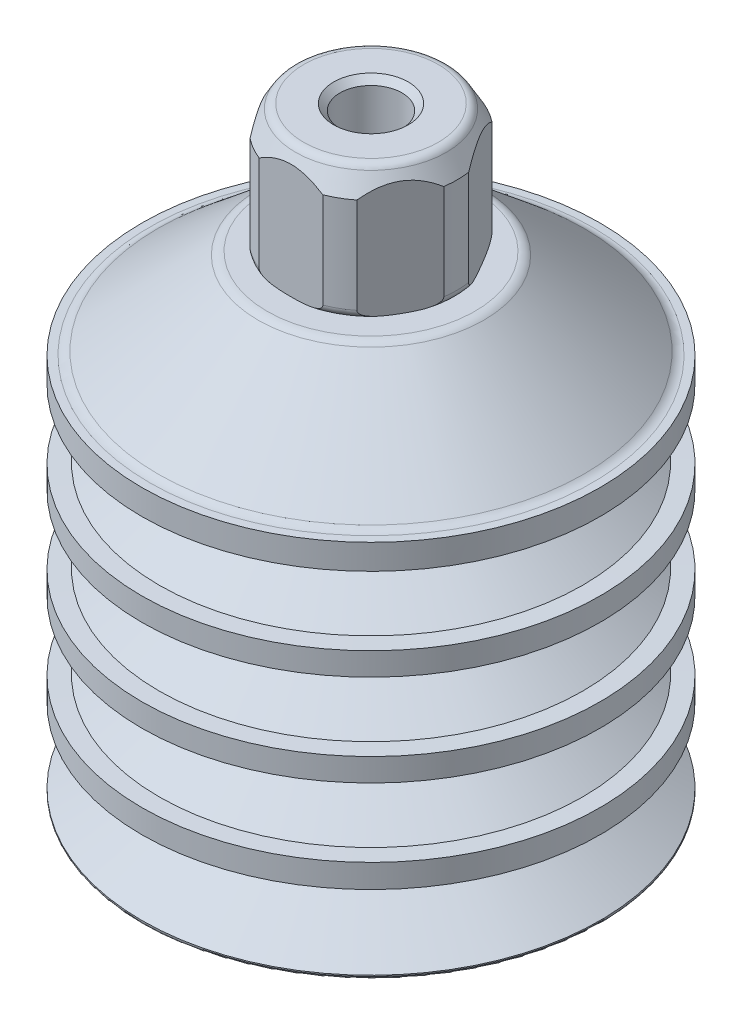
ISO-10303-21;
HEADER;
FILE_DESCRIPTION(('STEP AP214'),'2;1');
FILE_NAME('part.step','',(''),(''),'','','');
FILE_SCHEMA(('AUTOMOTIVE_DESIGN { 1 0 10303 214 1 1 1 1 }'));
ENDSEC;
DATA;
#1=APPLICATION_CONTEXT('core data for automotive mechanical design processes');
#2=APPLICATION_PROTOCOL_DEFINITION('international standard','automotive_design',2000,#1);
#3=PRODUCT_CONTEXT('',#1,'mechanical');
#4=PRODUCT('Part','Part','',(#3));
#5=PRODUCT_RELATED_PRODUCT_CATEGORY('part','',(#4));
#6=PRODUCT_DEFINITION_FORMATION('','',#4);
#7=PRODUCT_DEFINITION_CONTEXT('part definition',#1,'design');
#8=PRODUCT_DEFINITION('design','',#6,#7);
#9=PRODUCT_DEFINITION_SHAPE('','',#8);
#10=(LENGTH_UNIT() NAMED_UNIT(*) SI_UNIT(.MILLI.,.METRE.));
#11=(NAMED_UNIT(*) PLANE_ANGLE_UNIT() SI_UNIT($,.RADIAN.));
#12=(NAMED_UNIT(*) SI_UNIT($,.STERADIAN.) SOLID_ANGLE_UNIT());
#13=UNCERTAINTY_MEASURE_WITH_UNIT(LENGTH_MEASURE(1.E-05),#10,'distance_accuracy_value','');
#14=(GEOMETRIC_REPRESENTATION_CONTEXT(3) GLOBAL_UNCERTAINTY_ASSIGNED_CONTEXT((#13)) GLOBAL_UNIT_ASSIGNED_CONTEXT((#10,
#11,#12)) REPRESENTATION_CONTEXT('',''));
#15=CARTESIAN_POINT('',(0.,0.,0.));
#16=DIRECTION('',(0.,0.,1.));
#17=DIRECTION('',(1.,0.,0.));
#18=AXIS2_PLACEMENT_3D('',#15,#16,#17);
#19=CARTESIAN_POINT('',(26.11374,51.11242,0.));
#20=DIRECTION('',(0.,-1.,0.));
#21=DIRECTION('',(0.,0.,-1.));
#22=AXIS2_PLACEMENT_3D('',#19,#20,#21);
#23=PLANE('',#22);
#24=CARTESIAN_POINT('',(26.11374,51.11242,0.));
#25=DIRECTION('',(0.,1.,0.));
#26=DIRECTION('',(0.,0.,1.));
#27=AXIS2_PLACEMENT_3D('',#24,#25,#26);
#28=CIRCLE('',#27,11.34364);
#29=CARTESIAN_POINT('',(26.11374,51.11242,11.34364));
#30=VERTEX_POINT('',#29);
#31=EDGE_CURVE('E295',#30,#30,#28,.T.);
#32=ORIENTED_EDGE('',*,*,#31,.T.);
#33=EDGE_LOOP('',(#32));
#34=FACE_BOUND('',#33,.T.);
#35=CARTESIAN_POINT('',(26.11374,51.11242,0.));
#36=DIRECTION('',(0.,-1.,0.));
#37=DIRECTION('',(0.,0.,-1.));
#38=AXIS2_PLACEMENT_3D('',#35,#36,#37);
#39=CIRCLE('',#38,8.382);
#40=CARTESIAN_POINT('',(26.11374,51.11242,-8.382));
#41=VERTEX_POINT('',#40);
#42=EDGE_CURVE('E10',#41,#41,#39,.F.);
#43=ORIENTED_EDGE('',*,*,#42,.F.);
#44=EDGE_LOOP('',(#43));
#45=FACE_BOUND('',#44,.T.);
#46=ADVANCED_FACE('F17',(#34,#45),#23,.F.);
#47=CARTESIAN_POINT('',(51.11242,0.,0.));
#48=DIRECTION('',(0.,1.,0.));
#49=DIRECTION('',(0.,0.,1.));
#50=AXIS2_PLACEMENT_3D('',#47,#48,#49);
#51=PLANE('',#50);
#52=CARTESIAN_POINT('',(26.11374,0.,0.));
#53=DIRECTION('',(0.,1.,0.));
#54=DIRECTION('',(0.,0.,1.));
#55=AXIS2_PLACEMENT_3D('',#52,#53,#54);
#56=CIRCLE('',#55,24.74468);
#57=CARTESIAN_POINT('',(26.11374,0.,24.74468));
#58=VERTEX_POINT('',#57);
#59=EDGE_CURVE('E26',#58,#58,#56,.F.);
#60=ORIENTED_EDGE('',*,*,#59,.T.);
#61=EDGE_LOOP('',(#60));
#62=FACE_BOUND('',#61,.T.);
#63=ADVANCED_FACE('F415',(#62),#51,.F.);
#64=CARTESIAN_POINT('',(26.11374,51.11242,0.));
#65=DIRECTION('',(0.,1.,0.));
#66=DIRECTION('',(0.,0.,1.));
#67=AXIS2_PLACEMENT_3D('',#64,#65,#66);
#68=CYLINDRICAL_SURFACE('',#67,24.99868);
#69=CARTESIAN_POINT('',(26.11374,0.253999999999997,0.));
#70=DIRECTION('',(0.,1.,0.));
#71=DIRECTION('',(0.,0.,1.));
#72=AXIS2_PLACEMENT_3D('',#69,#70,#71);
#73=CIRCLE('',#72,24.99868);
#74=CARTESIAN_POINT('',(26.11374,0.253999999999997,24.99868));
#75=VERTEX_POINT('',#74);
#76=EDGE_CURVE('E407',#75,#75,#73,.T.);
#77=ORIENTED_EDGE('',*,*,#76,.T.);
#78=EDGE_LOOP('',(#77));
#79=FACE_BOUND('',#78,.T.);
#80=CARTESIAN_POINT('',(26.11374,0.380999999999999,0.));
#81=DIRECTION('',(0.,1.,0.));
#82=DIRECTION('',(0.,0.,1.));
#83=AXIS2_PLACEMENT_3D('',#80,#81,#82);
#84=CIRCLE('',#83,24.99868);
#85=CARTESIAN_POINT('',(26.11374,0.380999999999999,24.99868));
#86=VERTEX_POINT('',#85);
#87=EDGE_CURVE('E395',#86,#86,#84,.T.);
#88=ORIENTED_EDGE('',*,*,#87,.F.);
#89=EDGE_LOOP('',(#88));
#90=FACE_BOUND('',#89,.T.);
#91=ADVANCED_FACE('F422',(#79,#90),#68,.T.);
#92=CARTESIAN_POINT('',(26.11374,0.380999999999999,0.));
#93=DIRECTION('',(0.,-1.,0.));
#94=DIRECTION('',(0.,0.,-1.));
#95=AXIS2_PLACEMENT_3D('',#92,#93,#94);
#96=CONICAL_SURFACE('',#95,24.99868,1.02625360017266);
#97=CARTESIAN_POINT('',(26.11374,4.35864000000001,0.));
#98=DIRECTION('',(0.,1.,0.));
#99=DIRECTION('',(0.,0.,1.));
#100=AXIS2_PLACEMENT_3D('',#97,#98,#99);
#101=CIRCLE('',#100,18.4308157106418);
#102=CARTESIAN_POINT('',(26.11374,4.35864000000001,18.4308157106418));
#103=VERTEX_POINT('',#102);
#104=EDGE_CURVE('E391',#103,#103,#101,.T.);
#105=ORIENTED_EDGE('',*,*,#104,.F.);
#106=EDGE_LOOP('',(#105));
#107=FACE_BOUND('',#106,.T.);
#108=ORIENTED_EDGE('',*,*,#87,.T.);
#109=EDGE_LOOP('',(#108));
#110=FACE_BOUND('',#109,.T.);
#111=ADVANCED_FACE('F425',(#107,#110),#96,.T.);
#112=CARTESIAN_POINT('',(26.11374,4.76135156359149,0.));
#113=DIRECTION('',(0.,1.,0.));
#114=DIRECTION('',(0.,0.,1.));
#115=AXIS2_PLACEMENT_3D('',#112,#113,#114);
#116=TOROIDAL_SURFACE('',#115,18.7404726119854,0.507999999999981);
#117=CARTESIAN_POINT('',(26.11374,5.210308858,0.));
#118=DIRECTION('',(0.,1.,0.));
#119=DIRECTION('',(0.,0.,1.));
#120=AXIS2_PLACEMENT_3D('',#117,#118,#119);
#121=CIRCLE('',#120,18.5027724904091);
#122=CARTESIAN_POINT('',(26.11374,5.210308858,18.5027724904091));
#123=VERTEX_POINT('',#122);
#124=EDGE_CURVE('E387',#123,#123,#121,.T.);
#125=ORIENTED_EDGE('',*,*,#124,.F.);
#126=EDGE_LOOP('',(#125));
#127=FACE_BOUND('',#126,.T.);
#128=ORIENTED_EDGE('',*,*,#104,.T.);
#129=EDGE_LOOP('',(#128));
#130=FACE_BOUND('',#129,.T.);
#131=ADVANCED_FACE('F430',(#127,#130),#116,.F.);
#132=CARTESIAN_POINT('',(26.11374,5.210308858,0.));
#133=DIRECTION('',(0.,1.,0.));
#134=DIRECTION('',(0.,0.,1.));
#135=AXIS2_PLACEMENT_3D('',#132,#133,#134);
#136=CONICAL_SURFACE('',#135,18.5027724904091,0.963421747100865);
#137=CARTESIAN_POINT('',(26.11374,8.40989942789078,0.));
#138=DIRECTION('',(0.,1.,0.));
#139=DIRECTION('',(0.,0.,1.));
#140=AXIS2_PLACEMENT_3D('',#137,#138,#139);
#141=CIRCLE('',#140,23.10638);
#142=CARTESIAN_POINT('',(26.11374,8.40989942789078,23.10638));
#143=VERTEX_POINT('',#142);
#144=EDGE_CURVE('E383',#143,#143,#141,.T.);
#145=ORIENTED_EDGE('',*,*,#144,.F.);
#146=EDGE_LOOP('',(#145));
#147=FACE_BOUND('',#146,.T.);
#148=ORIENTED_EDGE('',*,*,#124,.T.);
#149=EDGE_LOOP('',(#148));
#150=FACE_BOUND('',#149,.T.);
#151=ADVANCED_FACE('F437',(#147,#150),#136,.T.);
#152=CARTESIAN_POINT('',(26.11374,8.40989942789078,0.));
#153=DIRECTION('',(0.,1.,0.));
#154=DIRECTION('',(0.,0.,1.));
#155=AXIS2_PLACEMENT_3D('',#152,#153,#154);
#156=CONICAL_SURFACE('',#155,23.10638,1.53588974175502);
#157=CARTESIAN_POINT('',(26.11374,8.47598,0.));
#158=DIRECTION('',(0.,1.,0.));
#159=DIRECTION('',(0.,0.,1.));
#160=AXIS2_PLACEMENT_3D('',#157,#158,#159);
#161=CIRCLE('',#160,24.99868);
#162=CARTESIAN_POINT('',(26.11374,8.47598,24.99868));
#163=VERTEX_POINT('',#162);
#164=EDGE_CURVE('E379',#163,#163,#161,.T.);
#165=ORIENTED_EDGE('',*,*,#164,.F.);
#166=EDGE_LOOP('',(#165));
#167=FACE_BOUND('',#166,.T.);
#168=ORIENTED_EDGE('',*,*,#144,.T.);
#169=EDGE_LOOP('',(#168));
#170=FACE_BOUND('',#169,.T.);
#171=ADVANCED_FACE('F536',(#167,#170),#156,.T.);
#172=CARTESIAN_POINT('',(26.11374,51.11242,0.));
#173=DIRECTION('',(0.,1.,0.));
#174=DIRECTION('',(0.,0.,1.));
#175=AXIS2_PLACEMENT_3D('',#172,#173,#174);
#176=CYLINDRICAL_SURFACE('',#175,24.99868);
#177=CARTESIAN_POINT('',(26.11374,11.04392,0.));
#178=DIRECTION('',(0.,1.,0.));
#179=DIRECTION('',(0.,0.,1.));
#180=AXIS2_PLACEMENT_3D('',#177,#178,#179);
#181=CIRCLE('',#180,24.99868);
#182=CARTESIAN_POINT('',(26.11374,11.04392,24.99868));
#183=VERTEX_POINT('',#182);
#184=EDGE_CURVE('E375',#183,#183,#181,.T.);
#185=ORIENTED_EDGE('',*,*,#184,.F.);
#186=EDGE_LOOP('',(#185));
#187=FACE_BOUND('',#186,.T.);
#188=ORIENTED_EDGE('',*,*,#164,.T.);
#189=EDGE_LOOP('',(#188));
#190=FACE_BOUND('',#189,.T.);
#191=ADVANCED_FACE('F532',(#187,#190),#176,.T.);
#192=CARTESIAN_POINT('',(26.11374,11.04392,0.));
#193=DIRECTION('',(0.,-1.,0.));
#194=DIRECTION('',(0.,0.,-1.));
#195=AXIS2_PLACEMENT_3D('',#192,#193,#194);
#196=CONICAL_SURFACE('',#195,24.99868,1.53588974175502);
#197=CARTESIAN_POINT('',(26.11374,11.1100005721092,0.));
#198=DIRECTION('',(0.,1.,0.));
#199=DIRECTION('',(0.,0.,1.));
#200=AXIS2_PLACEMENT_3D('',#197,#198,#199);
#201=CIRCLE('',#200,23.10638);
#202=CARTESIAN_POINT('',(26.11374,11.1100005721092,23.10638));
#203=VERTEX_POINT('',#202);
#204=EDGE_CURVE('E371',#203,#203,#201,.T.);
#205=ORIENTED_EDGE('',*,*,#204,.F.);
#206=EDGE_LOOP('',(#205));
#207=FACE_BOUND('',#206,.T.);
#208=ORIENTED_EDGE('',*,*,#184,.T.);
#209=EDGE_LOOP('',(#208));
#210=FACE_BOUND('',#209,.T.);
#211=ADVANCED_FACE('F528',(#207,#210),#196,.T.);
#212=CARTESIAN_POINT('',(26.11374,11.1100005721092,0.));
#213=DIRECTION('',(0.,-1.,0.));
#214=DIRECTION('',(0.,0.,-1.));
#215=AXIS2_PLACEMENT_3D('',#212,#213,#214);
#216=CONICAL_SURFACE('',#215,23.10638,0.963421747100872);
#217=CARTESIAN_POINT('',(26.11374,14.37581620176,0.));
#218=DIRECTION('',(0.,1.,0.));
#219=DIRECTION('',(0.,0.,1.));
#220=AXIS2_PLACEMENT_3D('',#217,#218,#219);
#221=CIRCLE('',#220,18.4074871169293);
#222=CARTESIAN_POINT('',(26.11374,14.37581620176,18.4074871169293));
#223=VERTEX_POINT('',#222);
#224=EDGE_CURVE('E367',#223,#223,#221,.T.);
#225=ORIENTED_EDGE('',*,*,#224,.F.);
#226=EDGE_LOOP('',(#225));
#227=FACE_BOUND('',#226,.T.);
#228=ORIENTED_EDGE('',*,*,#204,.T.);
#229=EDGE_LOOP('',(#228));
#230=FACE_BOUND('',#229,.T.);
#231=ADVANCED_FACE('F524',(#227,#230),#216,.T.);
#232=CARTESIAN_POINT('',(26.11374,14.79296,0.));
#233=DIRECTION('',(0.,1.,0.));
#234=DIRECTION('',(0.,0.,1.));
#235=AXIS2_PLACEMENT_3D('',#232,#233,#234);
#236=TOROIDAL_SURFACE('',#235,18.697409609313,0.508000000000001);
#237=CARTESIAN_POINT('',(26.11374,15.2101037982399,0.));
#238=DIRECTION('',(0.,1.,0.));
#239=DIRECTION('',(0.,0.,1.));
#240=AXIS2_PLACEMENT_3D('',#237,#238,#239);
#241=CIRCLE('',#240,18.4074871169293);
#242=CARTESIAN_POINT('',(26.11374,15.2101037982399,18.4074871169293));
#243=VERTEX_POINT('',#242);
#244=EDGE_CURVE('E363',#243,#243,#241,.T.);
#245=ORIENTED_EDGE('',*,*,#244,.F.);
#246=EDGE_LOOP('',(#245));
#247=FACE_BOUND('',#246,.T.);
#248=ORIENTED_EDGE('',*,*,#224,.T.);
#249=EDGE_LOOP('',(#248));
#250=FACE_BOUND('',#249,.T.);
#251=ADVANCED_FACE('F520',(#247,#250),#236,.F.);
#252=CARTESIAN_POINT('',(26.11374,15.2101037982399,0.));
#253=DIRECTION('',(0.,1.,0.));
#254=DIRECTION('',(0.,0.,1.));
#255=AXIS2_PLACEMENT_3D('',#252,#253,#254);
#256=CONICAL_SURFACE('',#255,18.4074871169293,0.963421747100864);
#257=CARTESIAN_POINT('',(26.11374,18.4759194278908,0.));
#258=DIRECTION('',(0.,1.,0.));
#259=DIRECTION('',(0.,0.,1.));
#260=AXIS2_PLACEMENT_3D('',#257,#258,#259);
#261=CIRCLE('',#260,23.10638);
#262=CARTESIAN_POINT('',(26.11374,18.4759194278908,23.10638));
#263=VERTEX_POINT('',#262);
#264=EDGE_CURVE('E359',#263,#263,#261,.T.);
#265=ORIENTED_EDGE('',*,*,#264,.F.);
#266=EDGE_LOOP('',(#265));
#267=FACE_BOUND('',#266,.T.);
#268=ORIENTED_EDGE('',*,*,#244,.T.);
#269=EDGE_LOOP('',(#268));
#270=FACE_BOUND('',#269,.T.);
#271=ADVANCED_FACE('F516',(#267,#270),#256,.T.);
#272=CARTESIAN_POINT('',(26.11374,18.4759194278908,0.));
#273=DIRECTION('',(0.,1.,0.));
#274=DIRECTION('',(0.,0.,1.));
#275=AXIS2_PLACEMENT_3D('',#272,#273,#274);
#276=CONICAL_SURFACE('',#275,23.10638,1.53588974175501);
#277=CARTESIAN_POINT('',(26.11374,18.542,0.));
#278=DIRECTION('',(0.,1.,0.));
#279=DIRECTION('',(0.,0.,1.));
#280=AXIS2_PLACEMENT_3D('',#277,#278,#279);
#281=CIRCLE('',#280,24.99868);
#282=CARTESIAN_POINT('',(26.11374,18.542,24.99868));
#283=VERTEX_POINT('',#282);
#284=EDGE_CURVE('E355',#283,#283,#281,.T.);
#285=ORIENTED_EDGE('',*,*,#284,.F.);
#286=EDGE_LOOP('',(#285));
#287=FACE_BOUND('',#286,.T.);
#288=ORIENTED_EDGE('',*,*,#264,.T.);
#289=EDGE_LOOP('',(#288));
#290=FACE_BOUND('',#289,.T.);
#291=ADVANCED_FACE('F512',(#287,#290),#276,.T.);
#292=CARTESIAN_POINT('',(26.11374,51.11242,0.));
#293=DIRECTION('',(0.,1.,0.));
#294=DIRECTION('',(0.,0.,1.));
#295=AXIS2_PLACEMENT_3D('',#292,#293,#294);
#296=CYLINDRICAL_SURFACE('',#295,24.99868);
#297=CARTESIAN_POINT('',(26.11374,21.0439,0.));
#298=DIRECTION('',(0.,1.,0.));
#299=DIRECTION('',(0.,0.,1.));
#300=AXIS2_PLACEMENT_3D('',#297,#298,#299);
#301=CIRCLE('',#300,24.99868);
#302=CARTESIAN_POINT('',(26.11374,21.0439,24.99868));
#303=VERTEX_POINT('',#302);
#304=EDGE_CURVE('E351',#303,#303,#301,.T.);
#305=ORIENTED_EDGE('',*,*,#304,.F.);
#306=EDGE_LOOP('',(#305));
#307=FACE_BOUND('',#306,.T.);
#308=ORIENTED_EDGE('',*,*,#284,.T.);
#309=EDGE_LOOP('',(#308));
#310=FACE_BOUND('',#309,.T.);
#311=ADVANCED_FACE('F508',(#307,#310),#296,.T.);
#312=CARTESIAN_POINT('',(26.11374,21.0439,0.));
#313=DIRECTION('',(0.,-1.,0.));
#314=DIRECTION('',(0.,0.,-1.));
#315=AXIS2_PLACEMENT_3D('',#312,#313,#314);
#316=CONICAL_SURFACE('',#315,24.99868,1.53588974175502);
#317=CARTESIAN_POINT('',(26.11374,21.1099805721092,0.));
#318=DIRECTION('',(0.,1.,0.));
#319=DIRECTION('',(0.,0.,1.));
#320=AXIS2_PLACEMENT_3D('',#317,#318,#319);
#321=CIRCLE('',#320,23.10638);
#322=CARTESIAN_POINT('',(26.11374,21.1099805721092,23.10638));
#323=VERTEX_POINT('',#322);
#324=EDGE_CURVE('E347',#323,#323,#321,.T.);
#325=ORIENTED_EDGE('',*,*,#324,.F.);
#326=EDGE_LOOP('',(#325));
#327=FACE_BOUND('',#326,.T.);
#328=ORIENTED_EDGE('',*,*,#304,.T.);
#329=EDGE_LOOP('',(#328));
#330=FACE_BOUND('',#329,.T.);
#331=ADVANCED_FACE('F504',(#327,#330),#316,.T.);
#332=CARTESIAN_POINT('',(26.11374,21.1099805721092,0.));
#333=DIRECTION('',(0.,-1.,0.));
#334=DIRECTION('',(0.,0.,-1.));
#335=AXIS2_PLACEMENT_3D('',#332,#333,#334);
#336=CONICAL_SURFACE('',#335,23.10638,0.963421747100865);
#337=CARTESIAN_POINT('',(26.11374,24.37638,0.));
#338=DIRECTION('',(0.,1.,0.));
#339=DIRECTION('',(0.,0.,1.));
#340=AXIS2_PLACEMENT_3D('',#337,#338,#339);
#341=CIRCLE('',#340,18.4066471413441);
#342=CARTESIAN_POINT('',(26.11374,24.37638,18.4066471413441));
#343=VERTEX_POINT('',#342);
#344=EDGE_CURVE('E343',#343,#343,#341,.T.);
#345=ORIENTED_EDGE('',*,*,#344,.F.);
#346=EDGE_LOOP('',(#345));
#347=FACE_BOUND('',#346,.T.);
#348=ORIENTED_EDGE('',*,*,#324,.T.);
#349=EDGE_LOOP('',(#348));
#350=FACE_BOUND('',#349,.T.);
#351=ADVANCED_FACE('F500',(#347,#350),#336,.T.);
#352=CARTESIAN_POINT('',(26.11374,24.7935237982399,0.));
#353=DIRECTION('',(0.,1.,0.));
#354=DIRECTION('',(0.,0.,1.));
#355=AXIS2_PLACEMENT_3D('',#352,#353,#354);
#356=TOROIDAL_SURFACE('',#355,18.6965696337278,0.508000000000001);
#357=CARTESIAN_POINT('',(26.11374,25.2095,0.));
#358=DIRECTION('',(0.,1.,0.));
#359=DIRECTION('',(0.,0.,1.));
#360=AXIS2_PLACEMENT_3D('',#357,#358,#359);
#361=CIRCLE('',#360,18.4049743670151);
#362=CARTESIAN_POINT('',(26.11374,25.2095,18.4049743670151));
#363=VERTEX_POINT('',#362);
#364=EDGE_CURVE('E339',#363,#363,#361,.T.);
#365=ORIENTED_EDGE('',*,*,#364,.F.);
#366=EDGE_LOOP('',(#365));
#367=FACE_BOUND('',#366,.T.);
#368=ORIENTED_EDGE('',*,*,#344,.T.);
#369=EDGE_LOOP('',(#368));
#370=FACE_BOUND('',#369,.T.);
#371=ADVANCED_FACE('F496',(#367,#370),#356,.F.);
#372=CARTESIAN_POINT('',(26.11374,25.2095,0.));
#373=DIRECTION('',(0.,1.,0.));
#374=DIRECTION('',(0.,0.,1.));
#375=AXIS2_PLACEMENT_3D('',#372,#373,#374);
#376=CONICAL_SURFACE('',#375,18.4049743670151,0.963421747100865);
#377=CARTESIAN_POINT('',(26.11374,28.4770620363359,0.));
#378=DIRECTION('',(0.,1.,0.));
#379=DIRECTION('',(0.,0.,1.));
#380=AXIS2_PLACEMENT_3D('',#377,#378,#379);
#381=CIRCLE('',#380,23.10638);
#382=CARTESIAN_POINT('',(26.11374,28.4770620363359,23.10638));
#383=VERTEX_POINT('',#382);
#384=EDGE_CURVE('E335',#383,#383,#381,.T.);
#385=ORIENTED_EDGE('',*,*,#384,.F.);
#386=EDGE_LOOP('',(#385));
#387=FACE_BOUND('',#386,.T.);
#388=ORIENTED_EDGE('',*,*,#364,.T.);
#389=EDGE_LOOP('',(#388));
#390=FACE_BOUND('',#389,.T.);
#391=ADVANCED_FACE('F492',(#387,#390),#376,.T.);
#392=CARTESIAN_POINT('',(26.11374,28.4770620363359,0.));
#393=DIRECTION('',(0.,1.,0.));
#394=DIRECTION('',(0.,0.,1.));
#395=AXIS2_PLACEMENT_3D('',#392,#393,#394);
#396=CONICAL_SURFACE('',#395,23.10638,1.53588974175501);
#397=CARTESIAN_POINT('',(26.11374,28.5431426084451,0.));
#398=DIRECTION('',(0.,1.,0.));
#399=DIRECTION('',(0.,0.,1.));
#400=AXIS2_PLACEMENT_3D('',#397,#398,#399);
#401=CIRCLE('',#400,24.99868);
#402=CARTESIAN_POINT('',(26.11374,28.5431426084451,24.99868));
#403=VERTEX_POINT('',#402);
#404=EDGE_CURVE('E331',#403,#403,#401,.T.);
#405=ORIENTED_EDGE('',*,*,#404,.F.);
#406=EDGE_LOOP('',(#405));
#407=FACE_BOUND('',#406,.T.);
#408=ORIENTED_EDGE('',*,*,#384,.T.);
#409=EDGE_LOOP('',(#408));
#410=FACE_BOUND('',#409,.T.);
#411=ADVANCED_FACE('F488',(#407,#410),#396,.T.);
#412=CARTESIAN_POINT('',(26.11374,51.11242,0.));
#413=DIRECTION('',(0.,1.,0.));
#414=DIRECTION('',(0.,0.,1.));
#415=AXIS2_PLACEMENT_3D('',#412,#413,#414);
#416=CYLINDRICAL_SURFACE('',#415,24.99868);
#417=CARTESIAN_POINT('',(26.11374,31.04388,0.));
#418=DIRECTION('',(0.,1.,0.));
#419=DIRECTION('',(0.,0.,1.));
#420=AXIS2_PLACEMENT_3D('',#417,#418,#419);
#421=CIRCLE('',#420,24.99868);
#422=CARTESIAN_POINT('',(26.11374,31.04388,24.99868));
#423=VERTEX_POINT('',#422);
#424=EDGE_CURVE('E327',#423,#423,#421,.T.);
#425=ORIENTED_EDGE('',*,*,#424,.F.);
#426=EDGE_LOOP('',(#425));
#427=FACE_BOUND('',#426,.T.);
#428=ORIENTED_EDGE('',*,*,#404,.T.);
#429=EDGE_LOOP('',(#428));
#430=FACE_BOUND('',#429,.T.);
#431=ADVANCED_FACE('F484',(#427,#430),#416,.T.);
#432=CARTESIAN_POINT('',(26.11374,31.04388,0.));
#433=DIRECTION('',(0.,-1.,0.));
#434=DIRECTION('',(0.,0.,-1.));
#435=AXIS2_PLACEMENT_3D('',#432,#433,#434);
#436=CONICAL_SURFACE('',#435,24.99868,1.53588974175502);
#437=CARTESIAN_POINT('',(26.11374,31.1099605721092,0.));
#438=DIRECTION('',(0.,1.,0.));
#439=DIRECTION('',(0.,0.,1.));
#440=AXIS2_PLACEMENT_3D('',#437,#438,#439);
#441=CIRCLE('',#440,23.10638);
#442=CARTESIAN_POINT('',(26.11374,31.1099605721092,23.10638));
#443=VERTEX_POINT('',#442);
#444=EDGE_CURVE('E323',#443,#443,#441,.T.);
#445=ORIENTED_EDGE('',*,*,#444,.F.);
#446=EDGE_LOOP('',(#445));
#447=FACE_BOUND('',#446,.T.);
#448=ORIENTED_EDGE('',*,*,#424,.T.);
#449=EDGE_LOOP('',(#448));
#450=FACE_BOUND('',#449,.T.);
#451=ADVANCED_FACE('F480',(#447,#450),#436,.T.);
#452=CARTESIAN_POINT('',(26.11374,31.1099605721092,0.));
#453=DIRECTION('',(0.,-1.,0.));
#454=DIRECTION('',(0.,0.,-1.));
#455=AXIS2_PLACEMENT_3D('',#452,#453,#454);
#456=CONICAL_SURFACE('',#455,23.10638,0.963421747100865);
#457=CARTESIAN_POINT('',(26.11374,34.37636,0.));
#458=DIRECTION('',(0.,1.,0.));
#459=DIRECTION('',(0.,0.,1.));
#460=AXIS2_PLACEMENT_3D('',#457,#458,#459);
#461=CIRCLE('',#460,18.4066471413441);
#462=CARTESIAN_POINT('',(26.11374,34.37636,18.4066471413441));
#463=VERTEX_POINT('',#462);
#464=EDGE_CURVE('E319',#463,#463,#461,.T.);
#465=ORIENTED_EDGE('',*,*,#464,.F.);
#466=EDGE_LOOP('',(#465));
#467=FACE_BOUND('',#466,.T.);
#468=ORIENTED_EDGE('',*,*,#444,.T.);
#469=EDGE_LOOP('',(#468));
#470=FACE_BOUND('',#469,.T.);
#471=ADVANCED_FACE('F476',(#467,#470),#456,.T.);
#472=CARTESIAN_POINT('',(26.11374,34.79292,0.));
#473=DIRECTION('',(0.,1.,0.));
#474=DIRECTION('',(0.,0.,1.));
#475=AXIS2_PLACEMENT_3D('',#472,#473,#474);
#476=TOROIDAL_SURFACE('',#475,18.6974078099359,0.507999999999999);
#477=CARTESIAN_POINT('',(26.11374,35.20948,0.));
#478=DIRECTION('',(0.,1.,0.));
#479=DIRECTION('',(0.,0.,1.));
#480=AXIS2_PLACEMENT_3D('',#477,#478,#479);
#481=CIRCLE('',#480,18.406647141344);
#482=CARTESIAN_POINT('',(26.11374,35.20948,18.406647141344));
#483=VERTEX_POINT('',#482);
#484=EDGE_CURVE('E315',#483,#483,#481,.T.);
#485=ORIENTED_EDGE('',*,*,#484,.F.);
#486=EDGE_LOOP('',(#485));
#487=FACE_BOUND('',#486,.T.);
#488=ORIENTED_EDGE('',*,*,#464,.T.);
#489=EDGE_LOOP('',(#488));
#490=FACE_BOUND('',#489,.T.);
#491=ADVANCED_FACE('F472',(#487,#490),#476,.F.);
#492=CARTESIAN_POINT('',(26.11374,35.20948,0.));
#493=DIRECTION('',(0.,1.,0.));
#494=DIRECTION('',(0.,0.,1.));
#495=AXIS2_PLACEMENT_3D('',#492,#493,#494);
#496=CONICAL_SURFACE('',#495,18.406647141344,0.963421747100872);
#497=CARTESIAN_POINT('',(26.11374,38.4758794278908,0.));
#498=DIRECTION('',(0.,1.,0.));
#499=DIRECTION('',(0.,0.,1.));
#500=AXIS2_PLACEMENT_3D('',#497,#498,#499);
#501=CIRCLE('',#500,23.10638);
#502=CARTESIAN_POINT('',(26.11374,38.4758794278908,23.10638));
#503=VERTEX_POINT('',#502);
#504=EDGE_CURVE('E311',#503,#503,#501,.T.);
#505=ORIENTED_EDGE('',*,*,#504,.F.);
#506=EDGE_LOOP('',(#505));
#507=FACE_BOUND('',#506,.T.);
#508=ORIENTED_EDGE('',*,*,#484,.T.);
#509=EDGE_LOOP('',(#508));
#510=FACE_BOUND('',#509,.T.);
#511=ADVANCED_FACE('F468',(#507,#510),#496,.T.);
#512=CARTESIAN_POINT('',(26.11374,38.4758794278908,0.));
#513=DIRECTION('',(0.,1.,0.));
#514=DIRECTION('',(0.,0.,1.));
#515=AXIS2_PLACEMENT_3D('',#512,#513,#514);
#516=CONICAL_SURFACE('',#515,23.10638,1.53588974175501);
#517=CARTESIAN_POINT('',(26.11374,38.54196,0.));
#518=DIRECTION('',(0.,1.,0.));
#519=DIRECTION('',(0.,0.,1.));
#520=AXIS2_PLACEMENT_3D('',#517,#518,#519);
#521=CIRCLE('',#520,24.99868);
#522=CARTESIAN_POINT('',(26.11374,38.54196,24.99868));
#523=VERTEX_POINT('',#522);
#524=EDGE_CURVE('E307',#523,#523,#521,.T.);
#525=ORIENTED_EDGE('',*,*,#524,.F.);
#526=EDGE_LOOP('',(#525));
#527=FACE_BOUND('',#526,.T.);
#528=ORIENTED_EDGE('',*,*,#504,.T.);
#529=EDGE_LOOP('',(#528));
#530=FACE_BOUND('',#529,.T.);
#531=ADVANCED_FACE('F464',(#527,#530),#516,.T.);
#532=CARTESIAN_POINT('',(26.11374,51.11242,0.));
#533=DIRECTION('',(0.,1.,0.));
#534=DIRECTION('',(0.,0.,1.));
#535=AXIS2_PLACEMENT_3D('',#532,#533,#534);
#536=CYLINDRICAL_SURFACE('',#535,24.99868);
#537=CARTESIAN_POINT('',(26.11374,41.287961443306,0.));
#538=DIRECTION('',(0.,1.,0.));
#539=DIRECTION('',(0.,0.,1.));
#540=AXIS2_PLACEMENT_3D('',#537,#538,#539);
#541=CIRCLE('',#540,24.99868);
#542=CARTESIAN_POINT('',(26.11374,41.287961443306,24.99868));
#543=VERTEX_POINT('',#542);
#544=EDGE_CURVE('E303',#543,#543,#541,.T.);
#545=ORIENTED_EDGE('',*,*,#544,.F.);
#546=EDGE_LOOP('',(#545));
#547=FACE_BOUND('',#546,.T.);
#548=ORIENTED_EDGE('',*,*,#524,.T.);
#549=EDGE_LOOP('',(#548));
#550=FACE_BOUND('',#549,.T.);
#551=ADVANCED_FACE('F460',(#547,#550),#536,.T.);
#552=CARTESIAN_POINT('',(26.11374,41.287961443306,0.));
#553=DIRECTION('',(0.,-1.,0.));
#554=DIRECTION('',(0.,0.,-1.));
#555=AXIS2_PLACEMENT_3D('',#552,#553,#554);
#556=CONICAL_SURFACE('',#555,24.99868,1.53588974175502);
#557=CARTESIAN_POINT('',(26.11374,41.3175601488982,0.));
#558=DIRECTION('',(0.,-1.,0.));
#559=DIRECTION('',(0.,0.,-1.));
#560=AXIS2_PLACEMENT_3D('',#557,#558,#559);
#561=CIRCLE('',#560,24.1510839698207);
#562=CARTESIAN_POINT('',(26.11374,41.3175601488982,-24.1510839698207));
#563=VERTEX_POINT('',#562);
#564=EDGE_CURVE('E403',#563,#563,#561,.T.);
#565=ORIENTED_EDGE('',*,*,#564,.T.);
#566=EDGE_LOOP('',(#565));
#567=FACE_BOUND('',#566,.T.);
#568=ORIENTED_EDGE('',*,*,#544,.T.);
#569=EDGE_LOOP('',(#568));
#570=FACE_BOUND('',#569,.T.);
#571=ADVANCED_FACE('F456',(#567,#570),#556,.T.);
#572=CARTESIAN_POINT('',(26.11374,41.3357700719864,0.));
#573=DIRECTION('',(0.,-1.,0.));
#574=DIRECTION('',(0.,0.,-1.));
#575=AXIS2_PLACEMENT_3D('',#572,#573,#574);
#576=CONICAL_SURFACE('',#575,23.62962,0.876155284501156);
#577=CARTESIAN_POINT('',(26.11374,41.6697676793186,0.));
#578=DIRECTION('',(0.,-1.,0.));
#579=DIRECTION('',(0.,0.,-1.));
#580=AXIS2_PLACEMENT_3D('',#577,#578,#579);
#581=CIRCLE('',#580,23.2287436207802);
#582=CARTESIAN_POINT('',(26.11374,41.6697676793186,-23.2287436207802));
#583=VERTEX_POINT('',#582);
#584=EDGE_CURVE('E399',#583,#583,#581,.F.);
#585=ORIENTED_EDGE('',*,*,#584,.T.);
#586=EDGE_LOOP('',(#585));
#587=FACE_BOUND('',#586,.T.);
#588=CARTESIAN_POINT('',(26.11374,50.7592840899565,0.));
#589=DIRECTION('',(0.,1.,0.));
#590=DIRECTION('',(0.,0.,1.));
#591=AXIS2_PLACEMENT_3D('',#588,#589,#590);
#592=CIRCLE('',#591,12.3191671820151);
#593=CARTESIAN_POINT('',(26.11374,50.7592840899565,12.3191671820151));
#594=VERTEX_POINT('',#593);
#595=EDGE_CURVE('E299',#594,#594,#592,.T.);
#596=ORIENTED_EDGE('',*,*,#595,.F.);
#597=EDGE_LOOP('',(#596));
#598=FACE_BOUND('',#597,.T.);
#599=ADVANCED_FACE('F452',(#587,#598),#576,.T.);
#600=CARTESIAN_POINT('',(26.11374,49.58842,0.));
#601=DIRECTION('',(0.,1.,0.));
#602=DIRECTION('',(0.,0.,1.));
#603=AXIS2_PLACEMENT_3D('',#600,#601,#602);
#604=TOROIDAL_SURFACE('',#603,11.34364,1.524);
#605=ORIENTED_EDGE('',*,*,#31,.F.);
#606=EDGE_LOOP('',(#605));
#607=FACE_BOUND('',#606,.T.);
#608=ORIENTED_EDGE('',*,*,#595,.T.);
#609=EDGE_LOOP('',(#608));
#610=FACE_BOUND('',#609,.T.);
#611=ADVANCED_FACE('F449',(#607,#610),#604,.T.);
#612=CARTESIAN_POINT('',(26.11374,42.8406317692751,0.));
#613=DIRECTION('',(0.,1.,0.));
#614=DIRECTION('',(0.,0.,1.));
#615=AXIS2_PLACEMENT_3D('',#612,#613,#614);
#616=TOROIDAL_SURFACE('',#615,24.2042708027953,1.524);
#617=ORIENTED_EDGE('',*,*,#564,.F.);
#618=EDGE_LOOP('',(#617));
#619=FACE_BOUND('',#618,.T.);
#620=ORIENTED_EDGE('',*,*,#584,.F.);
#621=EDGE_LOOP('',(#620));
#622=FACE_BOUND('',#621,.T.);
#623=ADVANCED_FACE('F419',(#619,#622),#616,.F.);
#624=CARTESIAN_POINT('',(26.11374,0.253999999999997,0.));
#625=DIRECTION('',(0.,1.,0.));
#626=DIRECTION('',(0.,0.,1.));
#627=AXIS2_PLACEMENT_3D('',#624,#625,#626);
#628=TOROIDAL_SURFACE('',#627,24.74468,0.254);
#629=ORIENTED_EDGE('',*,*,#59,.F.);
#630=EDGE_LOOP('',(#629));
#631=FACE_BOUND('',#630,.T.);
#632=ORIENTED_EDGE('',*,*,#76,.F.);
#633=EDGE_LOOP('',(#632));
#634=FACE_BOUND('',#633,.T.);
#635=ADVANCED_FACE('F19',(#631,#634),#628,.T.);
#636=CARTESIAN_POINT('',(26.11374,41.33342,0.));
#637=DIRECTION('',(0.,-1.,0.));
#638=DIRECTION('',(0.,0.,1.));
#639=AXIS2_PLACEMENT_3D('',#636,#637,#638);
#640=CYLINDRICAL_SURFACE('',#639,9.398);
#641=CARTESIAN_POINT('',(26.11374,62.5527597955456,0.));
#642=DIRECTION('',(0.,-1.,0.));
#643=DIRECTION('',(0.,0.,1.));
#644=AXIS2_PLACEMENT_3D('',#641,#642,#643);
#645=CIRCLE('',#644,9.398);
#646=CARTESIAN_POINT('',(16.8138888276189,62.5527597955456,1.35468526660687));
#647=VERTEX_POINT('',#646);
#648=CARTESIAN_POINT('',(16.8138888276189,62.5527597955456,-1.35468526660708));
#649=VERTEX_POINT('',#648);
#650=EDGE_CURVE('E150',#647,#649,#645,.T.);
#651=ORIENTED_EDGE('',*,*,#650,.T.);
#652=DIRECTION('',(0.,-1.,0.));
#653=VECTOR('',#652,1.);
#654=CARTESIAN_POINT('',(16.8138888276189,41.33342,-1.35468526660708));
#655=LINE('',#654,#653);
#656=CARTESIAN_POINT('',(16.8138888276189,52.12842,-1.35468526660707));
#657=VERTEX_POINT('',#656);
#658=EDGE_CURVE('E135',#649,#657,#655,.T.);
#659=ORIENTED_EDGE('',*,*,#658,.T.);
#660=CARTESIAN_POINT('',(26.11374,52.12842,0.));
#661=DIRECTION('',(0.,-1.,0.));
#662=DIRECTION('',(0.,0.,1.));
#663=AXIS2_PLACEMENT_3D('',#660,#661,#662);
#664=CIRCLE('',#663,9.398);
#665=CARTESIAN_POINT('',(16.8138888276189,52.12842,1.35468526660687));
#666=VERTEX_POINT('',#665);
#667=EDGE_CURVE('E148',#666,#657,#664,.T.);
#668=ORIENTED_EDGE('',*,*,#667,.F.);
#669=DIRECTION('',(0.,-1.,0.));
#670=VECTOR('',#669,1.);
#671=CARTESIAN_POINT('',(16.8138888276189,41.33342,1.35468526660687));
#672=LINE('',#671,#670);
#673=EDGE_CURVE('E50',#666,#647,#672,.F.);
#674=ORIENTED_EDGE('',*,*,#673,.T.);
#675=EDGE_LOOP('',(#651,#659,#668,#674));
#676=FACE_BOUND('',#675,.T.);
#677=ADVANCED_FACE('F147',(#676),#640,.T.);
#678=CARTESIAN_POINT('',(22.6370062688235,62.5527597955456,8.73124999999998));
#679=VERTEX_POINT('',#678);
#680=CARTESIAN_POINT('',(20.2906225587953,62.5527597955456,7.37656473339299));
#681=VERTEX_POINT('',#680);
#682=EDGE_CURVE('E1017',#679,#681,#645,.T.);
#683=ORIENTED_EDGE('',*,*,#682,.T.);
#684=DIRECTION('',(0.,-1.,0.));
#685=VECTOR('',#684,1.);
#686=CARTESIAN_POINT('',(20.2906225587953,41.33342,7.37656473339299));
#687=LINE('',#686,#685);
#688=CARTESIAN_POINT('',(20.2906225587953,52.12842,7.37656473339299));
#689=VERTEX_POINT('',#688);
#690=EDGE_CURVE('E264',#681,#689,#687,.T.);
#691=ORIENTED_EDGE('',*,*,#690,.T.);
#692=CARTESIAN_POINT('',(22.6370062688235,52.12842,8.73124999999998));
#693=VERTEX_POINT('',#692);
#694=EDGE_CURVE('E157',#693,#689,#664,.T.);
#695=ORIENTED_EDGE('',*,*,#694,.F.);
#696=DIRECTION('',(0.,-1.,0.));
#697=VECTOR('',#696,1.);
#698=CARTESIAN_POINT('',(22.6370062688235,41.33342,8.73124999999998));
#699=LINE('',#698,#697);
#700=EDGE_CURVE('E263',#693,#679,#699,.F.);
#701=ORIENTED_EDGE('',*,*,#700,.T.);
#702=EDGE_LOOP('',(#683,#691,#695,#701));
#703=FACE_BOUND('',#702,.T.);
#704=ADVANCED_FACE('F689',(#703),#640,.T.);
#705=CARTESIAN_POINT('',(31.9368574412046,62.5527597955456,7.37656473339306));
#706=VERTEX_POINT('',#705);
#707=CARTESIAN_POINT('',(29.5904737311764,62.5527597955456,8.73125000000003));
#708=VERTEX_POINT('',#707);
#709=EDGE_CURVE('E1027',#706,#708,#645,.T.);
#710=ORIENTED_EDGE('',*,*,#709,.T.);
#711=DIRECTION('',(0.,-1.,0.));
#712=VECTOR('',#711,1.);
#713=CARTESIAN_POINT('',(29.5904737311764,41.33342,8.73125000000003));
#714=LINE('',#713,#712);
#715=CARTESIAN_POINT('',(29.5904737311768,52.1284200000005,8.73125000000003));
#716=VERTEX_POINT('',#715);
#717=EDGE_CURVE('E1036',#708,#716,#714,.T.);
#718=ORIENTED_EDGE('',*,*,#717,.T.);
#719=CARTESIAN_POINT('',(31.9368574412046,52.12842,7.37656473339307));
#720=VERTEX_POINT('',#719);
#721=EDGE_CURVE('E164',#720,#716,#664,.T.);
#722=ORIENTED_EDGE('',*,*,#721,.F.);
#723=DIRECTION('',(0.,-1.,0.));
#724=VECTOR('',#723,1.);
#725=CARTESIAN_POINT('',(31.9368574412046,41.33342,7.37656473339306));
#726=LINE('',#725,#724);
#727=EDGE_CURVE('E1046',#720,#706,#726,.F.);
#728=ORIENTED_EDGE('',*,*,#727,.T.);
#729=EDGE_LOOP('',(#710,#718,#722,#728));
#730=FACE_BOUND('',#729,.T.);
#731=ADVANCED_FACE('F698',(#730),#640,.T.);
#732=CARTESIAN_POINT('',(35.4135911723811,62.5527597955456,-1.35468526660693));
#733=VERTEX_POINT('',#732);
#734=CARTESIAN_POINT('',(35.4135911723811,62.5527597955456,1.35468526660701));
#735=VERTEX_POINT('',#734);
#736=EDGE_CURVE('E185',#733,#735,#645,.T.);
#737=ORIENTED_EDGE('',*,*,#736,.T.);
#738=DIRECTION('',(0.,-1.,0.));
#739=VECTOR('',#738,1.);
#740=CARTESIAN_POINT('',(35.4135911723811,41.33342,1.35468526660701));
#741=LINE('',#740,#739);
#742=CARTESIAN_POINT('',(35.4135911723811,52.12842,1.35468526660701));
#743=VERTEX_POINT('',#742);
#744=EDGE_CURVE('E1050',#735,#743,#741,.T.);
#745=ORIENTED_EDGE('',*,*,#744,.T.);
#746=CARTESIAN_POINT('',(35.4135911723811,52.12842,-1.35468526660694));
#747=VERTEX_POINT('',#746);
#748=EDGE_CURVE('E173',#747,#743,#664,.T.);
#749=ORIENTED_EDGE('',*,*,#748,.F.);
#750=DIRECTION('',(0.,-1.,0.));
#751=VECTOR('',#750,1.);
#752=CARTESIAN_POINT('',(35.4135911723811,41.33342,-1.35468526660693));
#753=LINE('',#752,#751);
#754=EDGE_CURVE('E1060',#747,#733,#753,.F.);
#755=ORIENTED_EDGE('',*,*,#754,.T.);
#756=EDGE_LOOP('',(#737,#745,#749,#755));
#757=FACE_BOUND('',#756,.T.);
#758=ADVANCED_FACE('F708',(#757),#640,.T.);
#759=CARTESIAN_POINT('',(29.5904737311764,62.5527597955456,-8.73125));
#760=VERTEX_POINT('',#759);
#761=CARTESIAN_POINT('',(31.9368574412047,62.5527597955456,-7.37656473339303));
#762=VERTEX_POINT('',#761);
#763=EDGE_CURVE('E180',#760,#762,#645,.T.);
#764=ORIENTED_EDGE('',*,*,#763,.T.);
#765=DIRECTION('',(0.,-1.,0.));
#766=VECTOR('',#765,1.);
#767=CARTESIAN_POINT('',(31.9368574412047,41.33342,-7.37656473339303));
#768=LINE('',#767,#766);
#769=CARTESIAN_POINT('',(31.9368574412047,52.12842,-7.37656473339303));
#770=VERTEX_POINT('',#769);
#771=EDGE_CURVE('E224',#762,#770,#768,.T.);
#772=ORIENTED_EDGE('',*,*,#771,.T.);
#773=CARTESIAN_POINT('',(29.5904737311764,52.12842,-8.73125));
#774=VERTEX_POINT('',#773);
#775=EDGE_CURVE('E167',#774,#770,#664,.T.);
#776=ORIENTED_EDGE('',*,*,#775,.F.);
#777=DIRECTION('',(0.,-1.,0.));
#778=VECTOR('',#777,1.);
#779=CARTESIAN_POINT('',(29.5904737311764,41.33342,-8.73125));
#780=LINE('',#779,#778);
#781=EDGE_CURVE('E223',#774,#760,#780,.F.);
#782=ORIENTED_EDGE('',*,*,#781,.T.);
#783=EDGE_LOOP('',(#764,#772,#776,#782));
#784=FACE_BOUND('',#783,.T.);
#785=ADVANCED_FACE('F718',(#784),#640,.T.);
#786=CARTESIAN_POINT('',(18.17624,65.08242,0.));
#787=DIRECTION('',(0.,-1.,0.));
#788=DIRECTION('',(0.,0.,1.));
#789=AXIS2_PLACEMENT_3D('',#786,#787,#788);
#790=PLANE('',#789);
#791=CARTESIAN_POINT('',(26.11374,65.08242,0.));
#792=DIRECTION('',(0.,1.,0.));
#793=DIRECTION('',(0.,0.,-1.));
#794=AXIS2_PLACEMENT_3D('',#791,#792,#793);
#795=CIRCLE('',#794,4.064);
#796=CARTESIAN_POINT('',(26.11374,65.08242,-4.064));
#797=VERTEX_POINT('',#796);
#798=EDGE_CURVE('E878',#797,#797,#795,.T.);
#799=ORIENTED_EDGE('',*,*,#798,.F.);
#800=EDGE_LOOP('',(#799));
#801=FACE_BOUND('',#800,.T.);
#802=CARTESIAN_POINT('',(26.11374,65.08242,0.));
#803=DIRECTION('',(0.,-1.,0.));
#804=DIRECTION('',(0.,0.,1.));
#805=AXIS2_PLACEMENT_3D('',#802,#803,#804);
#806=CIRCLE('',#805,7.35091212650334);
#807=CARTESIAN_POINT('',(26.11374,65.08242,7.35091212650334));
#808=VERTEX_POINT('',#807);
#809=EDGE_CURVE('E291',#808,#808,#806,.F.);
#810=ORIENTED_EDGE('',*,*,#809,.T.);
#811=EDGE_LOOP('',(#810));
#812=FACE_BOUND('',#811,.T.);
#813=ADVANCED_FACE('F231',(#801,#812),#790,.F.);
#814=CARTESIAN_POINT('',(26.11374,65.08242,0.));
#815=DIRECTION('',(0.,-1.,0.));
#816=DIRECTION('',(0.,0.,1.));
#817=AXIS2_PLACEMENT_3D('',#814,#815,#816);
#818=CONICAL_SURFACE('',#817,7.9375,0.523598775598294);
#819=CARTESIAN_POINT('',(26.11374,64.57442,0.));
#820=DIRECTION('',(0.,1.,0.));
#821=DIRECTION('',(0.,0.,-1.));
#822=AXIS2_PLACEMENT_3D('',#819,#820,#821);
#823=CIRCLE('',#822,8.23079393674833);
#824=CARTESIAN_POINT('',(26.11374,64.57442,-8.23079393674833));
#825=VERTEX_POINT('',#824);
#826=EDGE_CURVE('E141',#825,#825,#823,.F.);
#827=ORIENTED_EDGE('',*,*,#826,.T.);
#828=EDGE_LOOP('',(#827));
#829=FACE_BOUND('',#828,.T.);
#830=CARTESIAN_POINT('',(20.2906225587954,62.5527597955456,-7.37656473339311));
#831=VERTEX_POINT('',#830);
#832=CARTESIAN_POINT('',(22.6370062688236,62.5527597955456,-8.73125));
#833=VERTEX_POINT('',#832);
#834=EDGE_CURVE('E172',#831,#833,#645,.T.);
#835=ORIENTED_EDGE('',*,*,#834,.F.);
#836=CARTESIAN_POINT('',(20.2907786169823,62.5525597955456,-7.37683503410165));
#837=CARTESIAN_POINT('',(20.2107888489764,62.6550366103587,-7.2382886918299));
#838=CARTESIAN_POINT('',(20.1293732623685,62.7533122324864,-7.09727275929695));
#839=CARTESIAN_POINT('',(19.963327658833,62.9395995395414,-6.8096733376));
#840=CARTESIAN_POINT('',(19.8786882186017,63.0275774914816,-6.66307352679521));
#841=CARTESIAN_POINT('',(19.7053723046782,63.1916435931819,-6.36288155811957));
#842=CARTESIAN_POINT('',(19.616661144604,63.267586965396,-6.2092293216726));
#843=CARTESIAN_POINT('',(19.4363577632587,63.4036112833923,-5.89693470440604));
#844=CARTESIAN_POINT('',(19.3447700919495,63.4637159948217,-5.73830020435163));
#845=CARTESIAN_POINT('',(19.1806920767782,63.5536631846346,-5.45410874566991));
#846=CARTESIAN_POINT('',(19.1087204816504,63.5872933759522,-5.3294502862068));
#847=CARTESIAN_POINT('',(18.9636263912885,63.6426654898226,-5.07813994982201));
#848=CARTESIAN_POINT('',(18.8905038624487,63.6644070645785,-4.95148801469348));
#849=CARTESIAN_POINT('',(18.7440544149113,63.6951205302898,-4.69783013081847));
#850=CARTESIAN_POINT('',(18.6707317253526,63.7041724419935,-4.57083150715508));
#851=CARTESIAN_POINT('',(18.5239724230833,63.7094232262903,-4.31663693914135));
#852=CARTESIAN_POINT('',(18.4505358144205,63.7056225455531,-4.18944100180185));
#853=CARTESIAN_POINT('',(18.3041668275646,63.6853222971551,-3.93592247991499));
#854=CARTESIAN_POINT('',(18.2312340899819,63.6688329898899,-3.80959927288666));
#855=CARTESIAN_POINT('',(18.086312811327,63.6237693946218,-3.55858825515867));
#856=CARTESIAN_POINT('',(18.0143243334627,63.5951943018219,-3.43390055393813));
#857=CARTESIAN_POINT('',(17.8712934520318,63.5267129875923,-3.18616380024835));
#858=CARTESIAN_POINT('',(17.800258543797,63.4867445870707,-3.06312773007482));
#859=CARTESIAN_POINT('',(17.6598006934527,63.3966926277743,-2.81984759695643));
#860=CARTESIAN_POINT('',(17.590378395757,63.3466051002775,-2.69960465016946));
#861=CARTESIAN_POINT('',(17.3972515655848,63.1929209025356,-2.36509916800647));
#862=CARTESIAN_POINT('',(17.2755682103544,63.0790550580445,-2.15433741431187));
#863=CARTESIAN_POINT('',(17.0982938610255,62.8921073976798,-1.8472892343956));
#864=CARTESIAN_POINT('',(17.0403787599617,62.8274947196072,-1.74697733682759));
#865=CARTESIAN_POINT('',(16.9260000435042,62.6934708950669,-1.54886758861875));
#866=CARTESIAN_POINT('',(16.869535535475,62.6240628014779,-1.4510681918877));
#867=CARTESIAN_POINT('',(16.8137327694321,62.5525597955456,-1.35441496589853));
#868=B_SPLINE_CURVE_WITH_KNOTS('',3,(#836,#837,#838,#839,#840,#841,#842,#843,#844,#845,#846,
#847,#848,#849,#850,#851,#852,#853,#854,#855,#856,#857,#858,#859,#860,#861,#862,#863,#864,#865,
#866,#867),.UNSPECIFIED.,.F.,.F.,(4,2,2,2,2,2,2,2,2,2,2,2,2,2,2,4),(0.,0.570096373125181,
1.14201088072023,1.72035458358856,2.29782548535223,2.74083821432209,3.18386390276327,
3.62408311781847,4.06428703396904,4.50413536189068,4.94401298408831,5.38633877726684,
5.82883838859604,6.63309300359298,7.03091274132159,7.4284815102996),.UNSPECIFIED.);
#869=EDGE_CURVE('E152',#831,#649,#868,.T.);
#870=ORIENTED_EDGE('',*,*,#869,.T.);
#871=ORIENTED_EDGE('',*,*,#650,.F.);
#872=CARTESIAN_POINT('',(16.8137327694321,62.5525597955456,1.35441496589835));
#873=CARTESIAN_POINT('',(16.8937225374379,62.6550366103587,1.49296130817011));
#874=CARTESIAN_POINT('',(16.9751381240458,62.7533122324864,1.63397724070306));
#875=CARTESIAN_POINT('',(17.1411837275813,62.9395995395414,1.92157666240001));
#876=CARTESIAN_POINT('',(17.2258231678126,63.0275774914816,2.0681764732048));
#877=CARTESIAN_POINT('',(17.3991390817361,63.1916435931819,2.36836844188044));
#878=CARTESIAN_POINT('',(17.4878502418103,63.267586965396,2.52202067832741));
#879=CARTESIAN_POINT('',(17.6681536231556,63.4036112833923,2.83431529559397));
#880=CARTESIAN_POINT('',(17.7597412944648,63.4637159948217,2.99294979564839));
#881=CARTESIAN_POINT('',(17.9238193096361,63.5536631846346,3.27714125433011));
#882=CARTESIAN_POINT('',(17.9957909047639,63.5872933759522,3.40179971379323));
#883=CARTESIAN_POINT('',(18.1408849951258,63.6426654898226,3.65311005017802));
#884=CARTESIAN_POINT('',(18.2140075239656,63.6644070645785,3.77976198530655));
#885=CARTESIAN_POINT('',(18.3604569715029,63.6951205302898,4.03341986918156));
#886=CARTESIAN_POINT('',(18.4337796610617,63.7041724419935,4.16041849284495));
#887=CARTESIAN_POINT('',(18.580538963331,63.7094232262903,4.41461306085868));
#888=CARTESIAN_POINT('',(18.6539755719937,63.7056225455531,4.54180899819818));
#889=CARTESIAN_POINT('',(18.8003445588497,63.6853222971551,4.79532752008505));
#890=CARTESIAN_POINT('',(18.8732772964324,63.6688329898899,4.92165072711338));
#891=CARTESIAN_POINT('',(19.0181985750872,63.6237693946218,5.17266174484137));
#892=CARTESIAN_POINT('',(19.0901870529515,63.5951943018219,5.29734944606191));
#893=CARTESIAN_POINT('',(19.2332179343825,63.5267129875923,5.54508619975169));
#894=CARTESIAN_POINT('',(19.3042528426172,63.4867445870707,5.66812226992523));
#895=CARTESIAN_POINT('',(19.4447106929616,63.3966926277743,5.91140240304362));
#896=CARTESIAN_POINT('',(19.5141329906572,63.3466051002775,6.03164534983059));
#897=CARTESIAN_POINT('',(19.7072598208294,63.1929209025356,6.36615083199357));
#898=CARTESIAN_POINT('',(19.8289431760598,63.0790550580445,6.57691258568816));
#899=CARTESIAN_POINT('',(20.0062175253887,62.8921073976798,6.88396076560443));
#900=CARTESIAN_POINT('',(20.0641326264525,62.8274947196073,6.98427266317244));
#901=CARTESIAN_POINT('',(20.1785113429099,62.6934708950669,7.18238241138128));
#902=CARTESIAN_POINT('',(20.2349758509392,62.624062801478,7.28018180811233));
#903=CARTESIAN_POINT('',(20.2907786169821,62.5525597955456,7.3768350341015));
#904=B_SPLINE_CURVE_WITH_KNOTS('',3,(#872,#873,#874,#875,#876,#877,#878,#879,#880,#881,#882,
#883,#884,#885,#886,#887,#888,#889,#890,#891,#892,#893,#894,#895,#896,#897,#898,#899,#900,#901,
#902,#903),.UNSPECIFIED.,.F.,.F.,(4,2,2,2,2,2,2,2,2,2,2,2,2,2,2,4),(0.,0.570096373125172,
1.14201088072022,1.72035458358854,2.29782548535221,2.74083821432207,3.18386390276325,
3.62408311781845,4.06428703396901,4.50413536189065,4.94401298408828,5.38633877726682,
5.82883838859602,6.63309300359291,7.03091274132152,7.42848151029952),.UNSPECIFIED.);
#905=EDGE_CURVE('E254',#647,#681,#904,.T.);
#906=ORIENTED_EDGE('',*,*,#905,.T.);
#907=ORIENTED_EDGE('',*,*,#682,.F.);
#908=CARTESIAN_POINT('',(37.7044006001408,53.6962457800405,8.73125000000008));
#909=CARTESIAN_POINT('',(37.5058462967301,53.9709058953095,8.73125000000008));
#910=CARTESIAN_POINT('',(37.3061022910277,54.2447127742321,8.73125000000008));
#911=CARTESIAN_POINT('',(36.9038267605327,54.7902996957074,8.73125000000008));
#912=CARTESIAN_POINT('',(36.7012950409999,55.0620795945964,8.73125000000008));
#913=CARTESIAN_POINT('',(36.2926128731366,55.6038512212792,8.73125000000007));
#914=CARTESIAN_POINT('',(36.0864554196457,55.8738376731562,8.73125000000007));
#915=CARTESIAN_POINT('',(35.6704615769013,56.41095550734,8.73125000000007));
#916=CARTESIAN_POINT('',(35.4606252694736,56.678086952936,8.73125000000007));
#917=CARTESIAN_POINT('',(35.0270502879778,57.2209663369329,8.73125000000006));
#918=CARTESIAN_POINT('',(34.8031126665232,57.496555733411,8.73125000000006));
#919=CARTESIAN_POINT('',(34.3496965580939,58.043135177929,8.73125000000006));
#920=CARTESIAN_POINT('',(34.1202182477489,58.3141253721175,8.73125000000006));
#921=CARTESIAN_POINT('',(33.6548430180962,58.850125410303,8.73125000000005));
#922=CARTESIAN_POINT('',(33.4189521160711,59.1151404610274,8.73125000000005));
#923=CARTESIAN_POINT('',(32.9392113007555,59.6378403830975,8.73125000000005));
#924=CARTESIAN_POINT('',(32.6953623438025,59.8955261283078,8.73125000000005));
#925=CARTESIAN_POINT('',(32.1895528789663,60.4099171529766,8.73125000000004));
#926=CARTESIAN_POINT('',(31.927258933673,60.6662965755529,8.73125000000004));
#927=CARTESIAN_POINT('',(31.3896236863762,61.1655146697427,8.73125000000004));
#928=CARTESIAN_POINT('',(31.1142736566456,61.4083440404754,8.73125000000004));
#929=CARTESIAN_POINT('',(30.5510009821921,61.872101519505,8.73125000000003));
#930=CARTESIAN_POINT('',(30.2632648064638,62.0932540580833,8.73125000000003));
#931=CARTESIAN_POINT('',(29.6691430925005,62.5086357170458,8.73125000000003));
#932=CARTESIAN_POINT('',(29.3627897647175,62.7029095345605,8.73125000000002));
#933=CARTESIAN_POINT('',(28.911932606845,62.9514735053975,8.73125000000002));
#934=CARTESIAN_POINT('',(28.7762186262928,63.021774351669,8.73125000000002));
#935=CARTESIAN_POINT('',(28.5005504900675,63.1544126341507,8.73125000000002));
#936=CARTESIAN_POINT('',(28.3605876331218,63.2167321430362,8.73125000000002));
#937=CARTESIAN_POINT('',(28.0763417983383,63.3321160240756,8.73125000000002));
#938=CARTESIAN_POINT('',(27.9320462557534,63.3851496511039,8.73125000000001));
#939=CARTESIAN_POINT('',(27.6399141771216,63.4803256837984,8.73125000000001));
#940=CARTESIAN_POINT('',(27.4920784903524,63.5224706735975,8.73125000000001));
#941=CARTESIAN_POINT('',(27.1935717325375,63.5945353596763,8.73125000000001));
#942=CARTESIAN_POINT('',(27.042903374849,63.6244661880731,8.73125000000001));
#943=CARTESIAN_POINT('',(26.7395226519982,63.6710700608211,8.73125));
#944=CARTESIAN_POINT('',(26.5868104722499,63.6877442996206,8.73125));
#945=CARTESIAN_POINT('',(26.2795828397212,63.7072273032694,8.73125));
#946=CARTESIAN_POINT('',(26.1250620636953,63.7099531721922,8.73125));
#947=CARTESIAN_POINT('',(25.8164284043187,63.7012001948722,8.73125));
#948=CARTESIAN_POINT('',(25.662315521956,63.6897213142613,8.73125));
#949=CARTESIAN_POINT('',(25.3557619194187,63.6530367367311,8.73124999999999));
#950=CARTESIAN_POINT('',(25.2033210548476,63.6278322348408,8.73124999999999));
#951=CARTESIAN_POINT('',(24.9011184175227,63.5646645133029,8.73124999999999));
#952=CARTESIAN_POINT('',(24.7513570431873,63.5266994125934,8.73124999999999));
#953=CARTESIAN_POINT('',(24.4068693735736,63.424988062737,8.73124999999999));
#954=CARTESIAN_POINT('',(24.2134330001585,63.3568713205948,8.73124999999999));
#955=CARTESIAN_POINT('',(23.8334299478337,63.2036418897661,8.73124999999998));
#956=CARTESIAN_POINT('',(23.6468664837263,63.1185213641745,8.73124999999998));
#957=CARTESIAN_POINT('',(23.2788909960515,62.9334257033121,8.73124999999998));
#958=CARTESIAN_POINT('',(23.0975527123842,62.8333053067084,8.73124999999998));
#959=CARTESIAN_POINT('',(22.7418256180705,62.6216268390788,8.73124999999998));
#960=CARTESIAN_POINT('',(22.5674346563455,62.5100723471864,8.73124999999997));
#961=CARTESIAN_POINT('',(22.1442729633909,62.2229630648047,8.73124999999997));
#962=CARTESIAN_POINT('',(21.8991697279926,62.0420175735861,8.73124999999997));
#963=CARTESIAN_POINT('',(21.4205420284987,61.6653114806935,8.73124999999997));
#964=CARTESIAN_POINT('',(21.1870250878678,61.4695414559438,8.73124999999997));
#965=CARTESIAN_POINT('',(20.7289775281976,61.0661668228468,8.73124999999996));
#966=CARTESIAN_POINT('',(20.5044832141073,60.8585212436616,8.73124999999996));
#967=CARTESIAN_POINT('',(20.0638347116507,60.4347150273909,8.73124999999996));
#968=CARTESIAN_POINT('',(19.8476785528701,60.2185564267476,8.73124999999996));
#969=CARTESIAN_POINT('',(19.4354710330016,59.7931088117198,8.73124999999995));
#970=CARTESIAN_POINT('',(19.2390030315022,59.5842216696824,8.73124999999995));
#971=CARTESIAN_POINT('',(18.8512702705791,59.1616507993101,8.73124999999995));
#972=CARTESIAN_POINT('',(18.6600059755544,58.947966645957,8.73124999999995));
#973=CARTESIAN_POINT('',(18.2836126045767,58.5185785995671,8.73124999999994));
#974=CARTESIAN_POINT('',(18.0984444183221,58.3029088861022,8.73124999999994));
#975=CARTESIAN_POINT('',(17.7319803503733,57.8683958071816,8.73124999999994));
#976=CARTESIAN_POINT('',(17.5506834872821,57.649553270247,8.73124999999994));
#977=CARTESIAN_POINT('',(17.3710120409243,57.4294037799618,8.73124999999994));
#978=B_SPLINE_CURVE_WITH_KNOTS('',3,(#908,#909,#910,#911,#912,#913,#914,#915,#916,#917,#918,
#919,#920,#921,#922,#923,#924,#925,#926,#927,#928,#929,#930,#931,#932,#933,#934,#935,#936,#937,
#938,#939,#940,#941,#942,#943,#944,#945,#946,#947,#948,#949,#950,#951,#952,#953,#954,#955,#956,
#957,#958,#959,#960,#961,#962,#963,#964,#965,#966,#967,#968,#969,#970,#971,#972,#973,#974,#975,
#976,#977),.UNSPECIFIED.,.F.,.F.,(4,2,2,2,2,2,2,2,2,2,2,2,2,2,2,2,2,2,2,2,2,2,2,2,2,2,2,2,2,2,2,
2,2,2,4),(0.,1.0167438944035,2.03355917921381,3.0526204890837,4.07165916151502,5.1369054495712,
6.20211782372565,7.26636298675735,8.33048072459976,9.43046874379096,10.5312027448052,
11.6189612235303,12.7048885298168,13.1632000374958,13.6225235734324,14.0833402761,
14.5440475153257,15.0043339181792,15.4645788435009,15.9275558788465,16.390534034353,
16.8534718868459,17.3164780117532,17.9307088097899,18.5452233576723,19.1661279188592,
19.7868387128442,20.6999961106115,21.6137389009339,22.5308504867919,23.4477440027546,
24.3079341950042,25.1682009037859,26.0209183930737,26.8734170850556),.UNSPECIFIED.);
#979=EDGE_CURVE('E247',#679,#708,#978,.F.);
#980=ORIENTED_EDGE('',*,*,#979,.T.);
#981=ORIENTED_EDGE('',*,*,#709,.F.);
#982=CARTESIAN_POINT('',(31.9367013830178,62.5525597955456,7.37683503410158));
#983=CARTESIAN_POINT('',(32.0166911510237,62.6550366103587,7.23828869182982));
#984=CARTESIAN_POINT('',(32.0981067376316,62.7533122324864,7.09727275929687));
#985=CARTESIAN_POINT('',(32.2641523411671,62.9395995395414,6.80967333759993));
#986=CARTESIAN_POINT('',(32.3487917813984,63.0275774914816,6.66307352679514));
#987=CARTESIAN_POINT('',(32.5221076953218,63.1916435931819,6.3628815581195));
#988=CARTESIAN_POINT('',(32.6108188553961,63.267586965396,6.20922932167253));
#989=CARTESIAN_POINT('',(32.7911222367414,63.4036112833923,5.89693470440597));
#990=CARTESIAN_POINT('',(32.8827099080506,63.4637159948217,5.73830020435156));
#991=CARTESIAN_POINT('',(33.0467879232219,63.5536631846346,5.45410874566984));
#992=CARTESIAN_POINT('',(33.1187595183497,63.5872933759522,5.32945028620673));
#993=CARTESIAN_POINT('',(33.2638536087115,63.6426654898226,5.07813994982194));
#994=CARTESIAN_POINT('',(33.3369761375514,63.6644070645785,4.95148801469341));
#995=CARTESIAN_POINT('',(33.4834255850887,63.6951205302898,4.6978301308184));
#996=CARTESIAN_POINT('',(33.5567482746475,63.7041724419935,4.57083150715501));
#997=CARTESIAN_POINT('',(33.7035075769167,63.7094232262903,4.31663693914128));
#998=CARTESIAN_POINT('',(33.7769441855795,63.7056225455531,4.18944100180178));
#999=CARTESIAN_POINT('',(33.9233131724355,63.685322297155,3.93592247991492));
#1000=CARTESIAN_POINT('',(33.9962459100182,63.6688329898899,3.80959927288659));
#1001=CARTESIAN_POINT('',(34.141167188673,63.6237693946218,3.55858825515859));
#1002=CARTESIAN_POINT('',(34.2131556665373,63.5951943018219,3.43390055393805));
#1003=CARTESIAN_POINT('',(34.3561865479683,63.5267129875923,3.18616380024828));
#1004=CARTESIAN_POINT('',(34.427221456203,63.4867445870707,3.06312773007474));
#1005=CARTESIAN_POINT('',(34.5676793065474,63.3966926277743,2.81984759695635));
#1006=CARTESIAN_POINT('',(34.637101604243,63.3466051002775,2.69960465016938));
#1007=CARTESIAN_POINT('',(34.8302284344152,63.1929209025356,2.36509916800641));
#1008=CARTESIAN_POINT('',(34.9519117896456,63.0790550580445,2.15433741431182));
#1009=CARTESIAN_POINT('',(35.1291861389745,62.8921073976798,1.84728923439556));
#1010=CARTESIAN_POINT('',(35.1871012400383,62.8274947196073,1.74697733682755));
#1011=CARTESIAN_POINT('',(35.3014799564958,62.6934708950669,1.54886758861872));
#1012=CARTESIAN_POINT('',(35.357944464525,62.624062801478,1.45106819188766));
#1013=CARTESIAN_POINT('',(35.4137472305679,62.5525597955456,1.3544149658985));
#1014=B_SPLINE_CURVE_WITH_KNOTS('',3,(#982,#983,#984,#985,#986,#987,#988,#989,#990,#991,#992,
#993,#994,#995,#996,#997,#998,#999,#1000,#1001,#1002,#1003,#1004,#1005,#1006,#1007,#1008,#1009,
#1010,#1011,#1012,#1013),.UNSPECIFIED.,.F.,.F.,(4,2,2,2,2,2,2,2,2,2,2,2,2,2,2,4),(0.,
0.570096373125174,1.14201088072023,1.72035458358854,2.29782548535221,2.74083821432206,
3.18386390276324,3.62408311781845,4.06428703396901,4.50413536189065,4.94401298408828,
5.38633877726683,5.82883838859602,6.6330930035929,7.0309127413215,7.4284815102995),.UNSPECIFIED.);
#1015=EDGE_CURVE('E241',#706,#735,#1014,.T.);
#1016=ORIENTED_EDGE('',*,*,#1015,.T.);
#1017=ORIENTED_EDGE('',*,*,#736,.F.);
#1018=CARTESIAN_POINT('',(35.4137472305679,62.5525597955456,-1.35441496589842));
#1019=CARTESIAN_POINT('',(35.3337574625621,62.6550366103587,-1.49296130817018));
#1020=CARTESIAN_POINT('',(35.2523418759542,62.7533122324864,-1.63397724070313));
#1021=CARTESIAN_POINT('',(35.0862962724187,62.9395995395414,-1.92157666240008));
#1022=CARTESIAN_POINT('',(35.0016568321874,63.0275774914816,-2.06817647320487));
#1023=CARTESIAN_POINT('',(34.8283409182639,63.1916435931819,-2.36836844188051));
#1024=CARTESIAN_POINT('',(34.7396297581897,63.267586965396,-2.52202067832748));
#1025=CARTESIAN_POINT('',(34.5593263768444,63.4036112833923,-2.83431529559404));
#1026=CARTESIAN_POINT('',(34.4677387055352,63.4637159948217,-2.99294979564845));
#1027=CARTESIAN_POINT('',(34.3036606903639,63.5536631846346,-3.27714125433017));
#1028=CARTESIAN_POINT('',(34.2316890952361,63.5872933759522,-3.40179971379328));
#1029=CARTESIAN_POINT('',(34.0865950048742,63.6426654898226,-3.65311005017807));
#1030=CARTESIAN_POINT('',(34.0134724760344,63.6644070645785,-3.7797619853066));
#1031=CARTESIAN_POINT('',(33.8670230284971,63.6951205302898,-4.03341986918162));
#1032=CARTESIAN_POINT('',(33.7937003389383,63.7041724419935,-4.160418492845));
#1033=CARTESIAN_POINT('',(33.646941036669,63.7094232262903,-4.41461306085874));
#1034=CARTESIAN_POINT('',(33.5735044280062,63.7056225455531,-4.54180899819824));
#1035=CARTESIAN_POINT('',(33.4271354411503,63.6853222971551,-4.79532752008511));
#1036=CARTESIAN_POINT('',(33.3542027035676,63.6688329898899,-4.92165072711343));
#1037=CARTESIAN_POINT('',(33.2092814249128,63.6237693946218,-5.17266174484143));
#1038=CARTESIAN_POINT('',(33.1372929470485,63.5951943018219,-5.29734944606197));
#1039=CARTESIAN_POINT('',(32.9942620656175,63.5267129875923,-5.54508619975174));
#1040=CARTESIAN_POINT('',(32.9232271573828,63.4867445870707,-5.66812226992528));
#1041=CARTESIAN_POINT('',(32.7827693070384,63.3966926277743,-5.91140240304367));
#1042=CARTESIAN_POINT('',(32.7133470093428,63.3466051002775,-6.03164534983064));
#1043=CARTESIAN_POINT('',(32.5202201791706,63.1929209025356,-6.36615083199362));
#1044=CARTESIAN_POINT('',(32.3985368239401,63.0790550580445,-6.57691258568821));
#1045=CARTESIAN_POINT('',(32.2212624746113,62.8921073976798,-6.88396076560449));
#1046=CARTESIAN_POINT('',(32.1633473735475,62.8274947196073,-6.98427266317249));
#1047=CARTESIAN_POINT('',(32.04896865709,62.6934708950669,-7.18238241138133));
#1048=CARTESIAN_POINT('',(31.9925041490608,62.624062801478,-7.28018180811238));
#1049=CARTESIAN_POINT('',(31.9367013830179,62.5525597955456,-7.37683503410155));
#1050=B_SPLINE_CURVE_WITH_KNOTS('',3,(#1018,#1019,#1020,#1021,#1022,#1023,#1024,#1025,#1026,
#1027,#1028,#1029,#1030,#1031,#1032,#1033,#1034,#1035,#1036,#1037,#1038,#1039,#1040,#1041,#1042,
#1043,#1044,#1045,#1046,#1047,#1048,#1049),.UNSPECIFIED.,.F.,.F.,(4,2,2,2,2,2,2,2,2,2,2,2,2,2,2,
4),(0.,0.570096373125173,1.14201088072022,1.72035458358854,2.29782548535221,2.74083821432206,
3.18386390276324,3.62408311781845,4.06428703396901,4.50413536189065,4.94401298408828,
5.38633877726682,5.82883838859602,6.63309300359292,7.03091274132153,7.42848151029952),.UNSPECIFIED.);
#1051=EDGE_CURVE('E215',#733,#762,#1050,.T.);
#1052=ORIENTED_EDGE('',*,*,#1051,.T.);
#1053=ORIENTED_EDGE('',*,*,#763,.F.);
#1054=CARTESIAN_POINT('',(37.7044006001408,53.6962457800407,-8.73125));
#1055=CARTESIAN_POINT('',(37.50584629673,53.9709058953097,-8.73125));
#1056=CARTESIAN_POINT('',(37.3061022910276,54.2447127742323,-8.73125));
#1057=CARTESIAN_POINT('',(36.9038267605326,54.7902996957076,-8.73125));
#1058=CARTESIAN_POINT('',(36.7012950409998,55.0620795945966,-8.73125));
#1059=CARTESIAN_POINT('',(36.2926128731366,55.6038512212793,-8.73125));
#1060=CARTESIAN_POINT('',(36.0864554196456,55.8738376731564,-8.73125));
#1061=CARTESIAN_POINT('',(35.6704615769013,56.4109555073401,-8.73125));
#1062=CARTESIAN_POINT('',(35.4606252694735,56.6780869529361,-8.73125));
#1063=CARTESIAN_POINT('',(35.0270502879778,57.220966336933,-8.73125));
#1064=CARTESIAN_POINT('',(34.8031126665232,57.4965557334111,-8.73125));
#1065=CARTESIAN_POINT('',(34.3496965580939,58.0431351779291,-8.73125));
#1066=CARTESIAN_POINT('',(34.1202182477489,58.3141253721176,-8.73125));
#1067=CARTESIAN_POINT('',(33.6548430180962,58.850125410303,-8.73125));
#1068=CARTESIAN_POINT('',(33.4189521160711,59.1151404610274,-8.73125));
#1069=CARTESIAN_POINT('',(32.9392113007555,59.6378403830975,-8.73125));
#1070=CARTESIAN_POINT('',(32.6953623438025,59.8955261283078,-8.73125));
#1071=CARTESIAN_POINT('',(32.1895528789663,60.4099171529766,-8.73125));
#1072=CARTESIAN_POINT('',(31.927258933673,60.6662965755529,-8.73125));
#1073=CARTESIAN_POINT('',(31.3896236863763,61.1655146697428,-8.73125));
#1074=CARTESIAN_POINT('',(31.1142736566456,61.4083440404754,-8.73125));
#1075=CARTESIAN_POINT('',(30.5510009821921,61.872101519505,-8.73125));
#1076=CARTESIAN_POINT('',(30.2632648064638,62.0932540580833,-8.73125));
#1077=CARTESIAN_POINT('',(29.6691430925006,62.5086357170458,-8.73125));
#1078=CARTESIAN_POINT('',(29.3627897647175,62.7029095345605,-8.73125));
#1079=CARTESIAN_POINT('',(28.9119326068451,62.9514735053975,-8.73125));
#1080=CARTESIAN_POINT('',(28.7762186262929,63.021774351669,-8.73125));
#1081=CARTESIAN_POINT('',(28.5005504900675,63.1544126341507,-8.73125));
#1082=CARTESIAN_POINT('',(28.3605876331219,63.2167321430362,-8.73125));
#1083=CARTESIAN_POINT('',(28.0763417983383,63.3321160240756,-8.73125));
#1084=CARTESIAN_POINT('',(27.9320462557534,63.3851496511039,-8.73125));
#1085=CARTESIAN_POINT('',(27.6399141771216,63.4803256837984,-8.73125));
#1086=CARTESIAN_POINT('',(27.4920784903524,63.5224706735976,-8.73125));
#1087=CARTESIAN_POINT('',(27.1935717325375,63.5945353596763,-8.73125));
#1088=CARTESIAN_POINT('',(27.042903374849,63.6244661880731,-8.73125));
#1089=CARTESIAN_POINT('',(26.7395226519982,63.6710700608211,-8.73125));
#1090=CARTESIAN_POINT('',(26.5868104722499,63.6877442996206,-8.73125));
#1091=CARTESIAN_POINT('',(26.2795828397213,63.7072273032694,-8.73125));
#1092=CARTESIAN_POINT('',(26.1250620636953,63.7099531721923,-8.73125));
#1093=CARTESIAN_POINT('',(25.8164284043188,63.7012001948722,-8.73125));
#1094=CARTESIAN_POINT('',(25.662315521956,63.6897213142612,-8.73125));
#1095=CARTESIAN_POINT('',(25.3557619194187,63.6530367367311,-8.73125));
#1096=CARTESIAN_POINT('',(25.2033210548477,63.6278322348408,-8.73125));
#1097=CARTESIAN_POINT('',(24.9011184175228,63.5646645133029,-8.73125));
#1098=CARTESIAN_POINT('',(24.7513570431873,63.5266994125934,-8.73125));
#1099=CARTESIAN_POINT('',(24.4068693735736,63.424988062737,-8.73125));
#1100=CARTESIAN_POINT('',(24.2134330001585,63.3568713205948,-8.73125));
#1101=CARTESIAN_POINT('',(23.8334299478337,63.2036418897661,-8.73125));
#1102=CARTESIAN_POINT('',(23.6468664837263,63.1185213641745,-8.73125));
#1103=CARTESIAN_POINT('',(23.2788909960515,62.9334257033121,-8.73125));
#1104=CARTESIAN_POINT('',(23.0975527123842,62.8333053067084,-8.73125));
#1105=CARTESIAN_POINT('',(22.7418256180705,62.6216268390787,-8.73125));
#1106=CARTESIAN_POINT('',(22.5674346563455,62.5100723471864,-8.73125));
#1107=CARTESIAN_POINT('',(22.1442729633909,62.2229630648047,-8.73125));
#1108=CARTESIAN_POINT('',(21.8991697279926,62.0420175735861,-8.73125));
#1109=CARTESIAN_POINT('',(21.4205420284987,61.6653114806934,-8.73125));
#1110=CARTESIAN_POINT('',(21.1870250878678,61.4695414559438,-8.73125));
#1111=CARTESIAN_POINT('',(20.7289775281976,61.0661668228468,-8.73125));
#1112=CARTESIAN_POINT('',(20.5044832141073,60.8585212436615,-8.73125));
#1113=CARTESIAN_POINT('',(20.0638347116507,60.4347150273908,-8.73125));
#1114=CARTESIAN_POINT('',(19.8476785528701,60.2185564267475,-8.73125));
#1115=CARTESIAN_POINT('',(19.4354710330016,59.7931088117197,-8.73125));
#1116=CARTESIAN_POINT('',(19.2390030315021,59.5842216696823,-8.73125));
#1117=CARTESIAN_POINT('',(18.8512702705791,59.1616507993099,-8.73125));
#1118=CARTESIAN_POINT('',(18.6600059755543,58.9479666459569,-8.73125));
#1119=CARTESIAN_POINT('',(18.2836126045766,58.5185785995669,-8.73125));
#1120=CARTESIAN_POINT('',(18.0984444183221,58.3029088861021,-8.73125));
#1121=CARTESIAN_POINT('',(17.7319803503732,57.8683958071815,-8.73125));
#1122=CARTESIAN_POINT('',(17.550683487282,57.6495532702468,-8.73125));
#1123=CARTESIAN_POINT('',(17.3710120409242,57.4294037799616,-8.73125));
#1124=B_SPLINE_CURVE_WITH_KNOTS('',3,(#1054,#1055,#1056,#1057,#1058,#1059,#1060,#1061,#1062,
#1063,#1064,#1065,#1066,#1067,#1068,#1069,#1070,#1071,#1072,#1073,#1074,#1075,#1076,#1077,#1078,
#1079,#1080,#1081,#1082,#1083,#1084,#1085,#1086,#1087,#1088,#1089,#1090,#1091,#1092,#1093,#1094,
#1095,#1096,#1097,#1098,#1099,#1100,#1101,#1102,#1103,#1104,#1105,#1106,#1107,#1108,#1109,#1110,
#1111,#1112,#1113,#1114,#1115,#1116,#1117,#1118,#1119,#1120,#1121,#1122,#1123),.UNSPECIFIED.,
.F.,.F.,(4,2,2,2,2,2,2,2,2,2,2,2,2,2,2,2,2,2,2,2,2,2,2,2,2,2,2,2,2,2,2,2,2,2,4),(0.,
1.01674389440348,2.03355917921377,3.05262048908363,4.07165916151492,5.13690544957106,
6.2021178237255,7.26636298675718,8.33048072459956,9.43046874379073,10.5312027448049,
11.61896122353,12.7048885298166,13.1632000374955,13.6225235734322,14.0833402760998,
14.5440475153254,15.004333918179,15.4645788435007,15.9275558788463,16.3905340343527,
16.8534718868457,17.316478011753,17.9307088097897,18.5452233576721,19.166127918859,
19.786838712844,20.6999961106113,21.6137389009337,22.5308504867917,23.4477440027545,
24.3079341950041,25.1682009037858,26.0209183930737,26.8734170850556),.UNSPECIFIED.);
#1125=EDGE_CURVE('E166',#760,#833,#1124,.T.);
#1126=ORIENTED_EDGE('',*,*,#1125,.T.);
#1127=EDGE_LOOP('',(#835,#870,#871,#906,#907,#980,#981,#1016,#1017,#1052,#1053,#1126));
#1128=FACE_BOUND('',#1127,.T.);
#1129=ADVANCED_FACE('F226',(#829,#1128),#818,.T.);
#1130=CARTESIAN_POINT('',(20.2906225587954,52.12842,-7.37656473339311));
#1131=VERTEX_POINT('',#1130);
#1132=CARTESIAN_POINT('',(22.6370062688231,52.1284200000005,-8.73125));
#1133=VERTEX_POINT('',#1132);
#1134=EDGE_CURVE('E158',#1131,#1133,#664,.T.);
#1135=ORIENTED_EDGE('',*,*,#1134,.F.);
#1136=DIRECTION('',(0.,-1.,0.));
#1137=VECTOR('',#1136,1.);
#1138=CARTESIAN_POINT('',(20.2906225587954,41.33342,-7.37656473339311));
#1139=LINE('',#1138,#1137);
#1140=EDGE_CURVE('E38',#1131,#831,#1139,.F.);
#1141=ORIENTED_EDGE('',*,*,#1140,.T.);
#1142=ORIENTED_EDGE('',*,*,#834,.T.);
#1143=DIRECTION('',(0.,-1.,0.));
#1144=VECTOR('',#1143,1.);
#1145=CARTESIAN_POINT('',(22.6370062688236,41.33342,-8.73125));
#1146=LINE('',#1145,#1144);
#1147=EDGE_CURVE('E1074',#833,#1133,#1146,.T.);
#1148=ORIENTED_EDGE('',*,*,#1147,.T.);
#1149=EDGE_LOOP('',(#1135,#1141,#1142,#1148));
#1150=FACE_BOUND('',#1149,.T.);
#1151=ADVANCED_FACE('F230',(#1150),#640,.T.);
#1152=CARTESIAN_POINT('',(26.11374,52.12842,0.));
#1153=DIRECTION('',(0.,-1.,0.));
#1154=DIRECTION('',(0.,0.,1.));
#1155=AXIS2_PLACEMENT_3D('',#1152,#1153,#1154);
#1156=TOROIDAL_SURFACE('',#1155,8.382,1.016);
#1157=ORIENTED_EDGE('',*,*,#42,.T.);
#1158=EDGE_LOOP('',(#1157));
#1159=FACE_BOUND('',#1158,.T.);
#1160=ORIENTED_EDGE('',*,*,#667,.T.);
#1161=CARTESIAN_POINT('',(16.8138888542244,52.12862,-1.35468531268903));
#1162=CARTESIAN_POINT('',(16.8138509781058,52.105165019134,-1.35461970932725));
#1163=CARTESIAN_POINT('',(16.8149724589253,52.0817913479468,-1.35656217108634));
#1164=CARTESIAN_POINT('',(16.8192411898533,52.0360713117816,-1.36395582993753));
#1165=CARTESIAN_POINT('',(16.8223642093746,52.0137160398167,-1.36936505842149));
#1166=CARTESIAN_POINT('',(16.8312480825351,51.9654616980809,-1.38475237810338));
#1167=CARTESIAN_POINT('',(16.8374425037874,51.9398873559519,-1.39548143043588));
#1168=CARTESIAN_POINT('',(16.8518238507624,51.8909974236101,-1.42039065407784));
#1169=CARTESIAN_POINT('',(16.860020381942,51.8676935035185,-1.43458746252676));
#1170=CARTESIAN_POINT('',(16.8830677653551,51.8104702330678,-1.47450670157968));
#1171=CARTESIAN_POINT('',(16.8990054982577,51.7783207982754,-1.50211166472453));
#1172=CARTESIAN_POINT('',(16.9330271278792,51.7190508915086,-1.56103885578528));
#1173=CARTESIAN_POINT('',(16.9511149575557,51.691939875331,-1.59236789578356));
#1174=CARTESIAN_POINT('',(16.9887372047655,51.6416621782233,-1.65753153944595));
#1175=CARTESIAN_POINT('',(17.008279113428,51.6185182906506,-1.69137911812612));
#1176=CARTESIAN_POINT('',(17.0482681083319,51.5755615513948,-1.76064208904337));
#1177=CARTESIAN_POINT('',(17.0687161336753,51.5557522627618,-1.79605910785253));
#1178=CARTESIAN_POINT('',(17.1102711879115,51.5188392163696,-1.868034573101));
#1179=CARTESIAN_POINT('',(17.1313798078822,51.5017427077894,-1.90459577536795));
#1180=CARTESIAN_POINT('',(17.1740106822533,51.4698705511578,-1.97843461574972));
#1181=CARTESIAN_POINT('',(17.1955326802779,51.4550935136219,-2.01571180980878));
#1182=CARTESIAN_POINT('',(17.2638436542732,51.4115648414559,-2.13402988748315));
#1183=CARTESIAN_POINT('',(17.3111901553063,51.3863153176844,-2.21603643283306));
#1184=CARTESIAN_POINT('',(17.4066356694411,51.3422230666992,-2.38135291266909));
#1185=CARTESIAN_POINT('',(17.454735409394,51.3233869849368,-2.46466410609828));
#1186=CARTESIAN_POINT('',(17.5514882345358,51.2904769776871,-2.63224491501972));
#1187=CARTESIAN_POINT('',(17.6001425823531,51.2764181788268,-2.71651671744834));
#1188=CARTESIAN_POINT('',(17.6976836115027,51.2519850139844,-2.88546273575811));
#1189=CARTESIAN_POINT('',(17.7465703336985,51.2416113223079,-2.97013702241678));
#1190=CARTESIAN_POINT('',(17.8447425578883,51.2236629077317,-3.1401763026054));
#1191=CARTESIAN_POINT('',(17.8940287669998,51.2161040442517,-3.22554252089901));
#1192=CARTESIAN_POINT('',(17.9926767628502,51.2032368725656,-3.39640586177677));
#1193=CARTESIAN_POINT('',(18.0420385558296,51.197928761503,-3.48190299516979));
#1194=CARTESIAN_POINT('',(18.1407122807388,51.1891148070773,-3.65281090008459));
#1195=CARTESIAN_POINT('',(18.190024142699,51.1856057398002,-3.73822155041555));
#1196=CARTESIAN_POINT('',(18.2886682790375,51.1800623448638,-3.90907820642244));
#1197=CARTESIAN_POINT('',(18.3380005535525,51.1780280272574,-3.99452421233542));
#1198=CARTESIAN_POINT('',(18.439750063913,51.1751585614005,-4.17075953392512));
#1199=CARTESIAN_POINT('',(18.4921678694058,51.1744060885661,-4.26154983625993));
#1200=CARTESIAN_POINT('',(18.5970035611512,51.1742714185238,-4.44313058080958));
#1201=CARTESIAN_POINT('',(18.6494214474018,51.1748892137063,-4.53392102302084));
#1202=CARTESIAN_POINT('',(18.7541000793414,51.1775569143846,-4.71522973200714));
#1203=CARTESIAN_POINT('',(18.8063608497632,51.1796027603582,-4.80574804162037));
#1204=CARTESIAN_POINT('',(18.9108553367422,51.185337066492,-4.98673780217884));
#1205=CARTESIAN_POINT('',(18.9630890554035,51.1890253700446,-5.07720925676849));
#1206=CARTESIAN_POINT('',(19.0867978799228,51.2001386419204,-5.29147922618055));
#1207=CARTESIAN_POINT('',(19.1582543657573,51.2084405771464,-5.41524549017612));
#1208=CARTESIAN_POINT('',(19.3009836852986,51.230278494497,-5.66245992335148));
#1209=CARTESIAN_POINT('',(19.3722565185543,51.2438144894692,-5.78590809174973));
#1210=CARTESIAN_POINT('',(19.4926282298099,51.2732043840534,-5.99439801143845));
#1211=CARTESIAN_POINT('',(19.5418456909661,51.287085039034,-6.07964515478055));
#1212=CARTESIAN_POINT('',(19.6399722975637,51.3197210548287,-6.24960542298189));
#1213=CARTESIAN_POINT('',(19.6888808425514,51.3384839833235,-6.33431750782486));
#1214=CARTESIAN_POINT('',(19.7645672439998,51.3728496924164,-6.46541020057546));
#1215=CARTESIAN_POINT('',(19.7916000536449,51.3862015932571,-6.5122324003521));
#1216=CARTESIAN_POINT('',(19.845328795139,51.4153700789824,-6.60529331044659));
#1217=CARTESIAN_POINT('',(19.8720248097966,51.4311860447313,-6.65153216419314));
#1218=CARTESIAN_POINT('',(19.9248582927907,51.4657594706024,-6.74304244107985));
#1219=CARTESIAN_POINT('',(19.950997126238,51.4845084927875,-6.78831622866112));
#1220=CARTESIAN_POINT('',(20.0025362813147,51.5256628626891,-6.87758466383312));
#1221=CARTESIAN_POINT('',(20.0279372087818,51.5480651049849,-6.92158036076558));
#1222=CARTESIAN_POINT('',(20.0714131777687,51.5913344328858,-6.99688294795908));
#1223=CARTESIAN_POINT('',(20.0897369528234,51.6111938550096,-7.02862065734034));
#1224=CARTESIAN_POINT('',(20.1254812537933,51.6541074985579,-7.09053160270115));
#1225=CARTESIAN_POINT('',(20.1429003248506,51.6771666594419,-7.1207023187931));
#1226=CARTESIAN_POINT('',(20.1764893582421,51.727377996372,-7.17888023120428));
#1227=CARTESIAN_POINT('',(20.1926453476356,51.7545682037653,-7.20686322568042));
#1228=CARTESIAN_POINT('',(20.2226565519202,51.8136687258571,-7.25884415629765));
#1229=CARTESIAN_POINT('',(20.2365183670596,51.8455649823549,-7.2828535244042));
#1230=CARTESIAN_POINT('',(20.2555812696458,51.9003473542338,-7.31587144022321));
#1231=CARTESIAN_POINT('',(20.2619976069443,51.9215313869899,-7.3269848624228));
#1232=CARTESIAN_POINT('',(20.273136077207,51.9655695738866,-7.34627725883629));
#1233=CARTESIAN_POINT('',(20.2778638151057,51.9884178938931,-7.35446594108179));
#1234=CARTESIAN_POINT('',(20.2844880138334,52.0307113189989,-7.3659393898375));
#1235=CARTESIAN_POINT('',(20.2867624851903,52.049917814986,-7.36987888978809));
#1236=CARTESIAN_POINT('',(20.2898468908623,52.0889408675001,-7.37522123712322));
#1237=CARTESIAN_POINT('',(20.2906454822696,52.1087609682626,-7.37660443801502));
#1238=CARTESIAN_POINT('',(20.29062253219,52.12862,-7.37656468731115));
#1239=B_SPLINE_CURVE_WITH_KNOTS('',3,(#1161,#1162,#1163,#1164,#1165,#1166,#1167,#1168,#1169,
#1170,#1171,#1172,#1173,#1174,#1175,#1176,#1177,#1178,#1179,#1180,#1181,#1182,#1183,#1184,#1185,
#1186,#1187,#1188,#1189,#1190,#1191,#1192,#1193,#1194,#1195,#1196,#1197,#1198,#1199,#1200,#1201,
#1202,#1203,#1204,#1205,#1206,#1207,#1208,#1209,#1210,#1211,#1212,#1213,#1214,#1215,#1216,#1217,
#1218,#1219,#1220,#1221,#1222,#1223,#1224,#1225,#1226,#1227,#1228,#1229,#1230,#1231,#1232,#1233,
#1234,#1235,#1236,#1237,#1238),.UNSPECIFIED.,.F.,.F.,(4,2,2,2,2,2,2,2,2,2,2,2,2,2,2,2,2,2,2,2,2,
2,2,2,2,2,2,2,2,2,2,2,2,2,2,2,2,2,4),(0.,0.0701236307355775,0.139413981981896,0.224191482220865,
0.309383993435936,0.44443845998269,0.579743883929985,0.715802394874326,0.852005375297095,
0.988566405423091,1.12504531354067,1.41868113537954,1.71262029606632,2.00748168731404,
2.3023970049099,2.59894966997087,2.89552830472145,3.19157359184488,3.48762089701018,
3.80212649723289,4.1166303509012,4.43024378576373,4.74382732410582,5.17322860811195,
5.60263094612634,5.90077760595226,6.19938918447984,6.36641409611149,6.53339710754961,
6.69990828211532,6.86627864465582,6.99120625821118,7.11632891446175,7.24268239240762,
7.36866578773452,7.44274356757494,7.51657312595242,7.57556855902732,7.63501554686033),.UNSPECIFIED.);
#1240=EDGE_CURVE('E132',#657,#1131,#1239,.T.);
#1241=ORIENTED_EDGE('',*,*,#1240,.T.);
#1242=ORIENTED_EDGE('',*,*,#1134,.T.);
#1243=CARTESIAN_POINT('',(26.11374,51.1743338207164,-8.73125));
#1244=CARTESIAN_POINT('',(26.2831944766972,51.1743312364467,-8.73125));
#1245=CARTESIAN_POINT('',(26.4526504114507,51.1760965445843,-8.73125));
#1246=CARTESIAN_POINT('',(26.7915442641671,51.1836578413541,-8.73125));
#1247=CARTESIAN_POINT('',(26.9609821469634,51.1894554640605,-8.73125));
#1248=CARTESIAN_POINT('',(27.3002555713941,51.2066586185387,-8.73125));
#1249=CARTESIAN_POINT('',(27.470090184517,51.2180853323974,-8.73125));
#1250=CARTESIAN_POINT('',(27.7241921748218,51.2416457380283,-8.73125));
#1251=CARTESIAN_POINT('',(27.8087543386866,51.2505649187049,-8.73125));
#1252=CARTESIAN_POINT('',(27.9775458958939,51.271103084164,-8.73125));
#1253=CARTESIAN_POINT('',(28.0617753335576,51.2827216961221,-8.73125));
#1254=CARTESIAN_POINT('',(28.2305848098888,51.3095022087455,-8.73125));
#1255=CARTESIAN_POINT('',(28.3151592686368,51.3246999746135,-8.73125));
#1256=CARTESIAN_POINT('',(28.4834964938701,51.3595804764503,-8.73125));
#1257=CARTESIAN_POINT('',(28.5672583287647,51.3792678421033,-8.73125));
#1258=CARTESIAN_POINT('',(28.7326508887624,51.4243697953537,-8.73125));
#1259=CARTESIAN_POINT('',(28.8142921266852,51.4497451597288,-8.73125));
#1260=CARTESIAN_POINT('',(28.9746754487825,51.5082887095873,-8.73125));
#1261=CARTESIAN_POINT('',(29.0534239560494,51.5414382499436,-8.73125));
#1262=CARTESIAN_POINT('',(29.1762963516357,51.6040376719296,-8.73125));
#1263=CARTESIAN_POINT('',(29.2221494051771,51.6300583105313,-8.73125));
#1264=CARTESIAN_POINT('',(29.3103783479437,51.6875314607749,-8.73125));
#1265=CARTESIAN_POINT('',(29.3527593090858,51.7189758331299,-8.73125));
#1266=CARTESIAN_POINT('',(29.4166793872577,51.7756436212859,-8.73125));
#1267=CARTESIAN_POINT('',(29.4400658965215,51.798764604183,-8.73125));
#1268=CARTESIAN_POINT('',(29.483398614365,51.8480659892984,-8.73125));
#1269=CARTESIAN_POINT('',(29.5033495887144,51.8742420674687,-8.73125));
#1270=CARTESIAN_POINT('',(29.5339545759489,51.9229152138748,-8.73125));
#1271=CARTESIAN_POINT('',(29.545687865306,51.9447259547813,-8.73125));
#1272=CARTESIAN_POINT('',(29.565488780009,51.9899622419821,-8.73125));
#1273=CARTESIAN_POINT('',(29.5735606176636,52.0133858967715,-8.73125));
#1274=CARTESIAN_POINT('',(29.585311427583,52.0615822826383,-8.73125));
#1275=CARTESIAN_POINT('',(29.5889469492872,52.0863659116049,-8.73125));
#1276=CARTESIAN_POINT('',(29.5912172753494,52.1361605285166,-8.73125));
#1277=CARTESIAN_POINT('',(29.5898543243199,52.1611714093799,-8.73125));
#1278=CARTESIAN_POINT('',(29.5828463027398,52.2069976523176,-8.73125));
#1279=CARTESIAN_POINT('',(29.5778230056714,52.2279128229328,-8.73125));
#1280=CARTESIAN_POINT('',(29.5646512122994,52.2687247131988,-8.73125));
#1281=CARTESIAN_POINT('',(29.5565012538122,52.288620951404,-8.73125));
#1282=CARTESIAN_POINT('',(29.5330583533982,52.3364279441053,-8.73125));
#1283=CARTESIAN_POINT('',(29.5162161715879,52.3635754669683,-8.73125));
#1284=CARTESIAN_POINT('',(29.4784981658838,52.4149036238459,-8.73125));
#1285=CARTESIAN_POINT('',(29.4576113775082,52.4390758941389,-8.73125));
#1286=CARTESIAN_POINT('',(29.3972387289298,52.5008757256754,-8.73125));
#1287=CARTESIAN_POINT('',(29.355079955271,52.5358648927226,-8.73125));
#1288=CARTESIAN_POINT('',(29.2663164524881,52.5995129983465,-8.73125));
#1289=CARTESIAN_POINT('',(29.2197017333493,52.6281572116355,-8.73125));
#1290=CARTESIAN_POINT('',(29.1076715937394,52.6893710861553,-8.73125));
#1291=CARTESIAN_POINT('',(29.0412148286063,52.7200099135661,-8.73125));
#1292=CARTESIAN_POINT('',(28.9056711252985,52.7749077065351,-8.73125));
#1293=CARTESIAN_POINT('',(28.836579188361,52.7991537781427,-8.73125));
#1294=CARTESIAN_POINT('',(28.6964707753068,52.8428768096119,-8.73125));
#1295=CARTESIAN_POINT('',(28.6254452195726,52.8623241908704,-8.73125));
#1296=CARTESIAN_POINT('',(28.4825430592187,52.8973270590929,-8.73125));
#1297=CARTESIAN_POINT('',(28.4106674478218,52.9128866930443,-8.73125));
#1298=CARTESIAN_POINT('',(28.2654631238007,52.9410947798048,-8.73125));
#1299=CARTESIAN_POINT('',(28.1921273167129,52.9537061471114,-8.73125));
#1300=CARTESIAN_POINT('',(28.0450588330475,52.9763819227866,-8.73125));
#1301=CARTESIAN_POINT('',(27.9713260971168,52.9864459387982,-8.73125));
#1302=CARTESIAN_POINT('',(27.7496593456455,53.0135573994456,-8.73125));
#1303=CARTESIAN_POINT('',(27.6013489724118,53.0275077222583,-8.73125));
#1304=CARTESIAN_POINT('',(27.3038853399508,53.0498571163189,-8.73125));
#1305=CARTESIAN_POINT('',(27.1547308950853,53.0582387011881,-8.73125));
#1306=CARTESIAN_POINT('',(26.8563121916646,53.0710207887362,-8.73125));
#1307=CARTESIAN_POINT('',(26.7070479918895,53.075422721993,-8.73125));
#1308=CARTESIAN_POINT('',(26.4082125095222,53.0811823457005,-8.73125));
#1309=CARTESIAN_POINT('',(26.2586411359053,53.0825348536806,-8.73125));
#1310=CARTESIAN_POINT('',(25.959477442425,53.0824765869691,-8.73125));
#1311=CARTESIAN_POINT('',(25.8098851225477,53.0810654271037,-8.73125));
#1312=CARTESIAN_POINT('',(25.5110615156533,53.075174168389,-8.73125));
#1313=CARTESIAN_POINT('',(25.3618301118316,53.0707003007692,-8.73125));
#1314=CARTESIAN_POINT('',(25.0635518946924,53.057760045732,-8.73125));
#1315=CARTESIAN_POINT('',(24.9145050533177,53.0492943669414,-8.73125));
#1316=CARTESIAN_POINT('',(24.6522762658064,53.0293738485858,-8.73125));
#1317=CARTESIAN_POINT('',(24.5390064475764,53.019111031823,-8.73125));
#1318=CARTESIAN_POINT('',(24.3128415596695,52.994145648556,-8.73125));
#1319=CARTESIAN_POINT('',(24.1999468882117,52.9794393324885,-8.73125));
#1320=CARTESIAN_POINT('',(23.9754202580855,52.9440363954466,-8.73125));
#1321=CARTESIAN_POINT('',(23.8637854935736,52.9233582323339,-8.73125));
#1322=CARTESIAN_POINT('',(23.6424776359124,52.8736644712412,-8.73125));
#1323=CARTESIAN_POINT('',(23.532801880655,52.8446612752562,-8.73125));
#1324=CARTESIAN_POINT('',(23.3400841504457,52.7818977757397,-8.73125));
#1325=CARTESIAN_POINT('',(23.2563270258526,52.7504511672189,-8.73125));
#1326=CARTESIAN_POINT('',(23.1344806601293,52.6952670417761,-8.73125));
#1327=CARTESIAN_POINT('',(23.0945673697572,52.675580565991,-8.73125));
#1328=CARTESIAN_POINT('',(23.016541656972,52.6329442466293,-8.73125));
#1329=CARTESIAN_POINT('',(22.9784272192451,52.6099981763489,-8.73125));
#1330=CARTESIAN_POINT('',(22.9141278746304,52.5663541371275,-8.73125));
#1331=CARTESIAN_POINT('',(22.8873495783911,52.5465371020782,-8.73125));
#1332=CARTESIAN_POINT('',(22.8358958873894,52.5042271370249,-8.73125));
#1333=CARTESIAN_POINT('',(22.8112234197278,52.48173058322,-8.73125));
#1334=CARTESIAN_POINT('',(22.7647199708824,52.4334189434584,-8.73125));
#1335=CARTESIAN_POINT('',(22.742924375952,52.4075691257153,-8.73125));
#1336=CARTESIAN_POINT('',(22.7040676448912,52.3525179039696,-8.73125));
#1337=CARTESIAN_POINT('',(22.6869918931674,52.3233272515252,-8.73125));
#1338=CARTESIAN_POINT('',(22.664125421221,52.2721433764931,-8.73125));
#1339=CARTESIAN_POINT('',(22.6564702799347,52.2509876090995,-8.73125));
#1340=CARTESIAN_POINT('',(22.6447548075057,52.2077004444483,-8.73125));
#1341=CARTESIAN_POINT('',(22.6406907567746,52.1855700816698,-8.73125));
#1342=CARTESIAN_POINT('',(22.6365423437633,52.1408370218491,-8.73125));
#1343=CARTESIAN_POINT('',(22.6364747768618,52.1182327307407,-8.73125));
#1344=CARTESIAN_POINT('',(22.6403695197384,52.0733725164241,-8.73125));
#1345=CARTESIAN_POINT('',(22.6443335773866,52.051116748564,-8.73125));
#1346=CARTESIAN_POINT('',(22.6556214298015,52.0086202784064,-8.73125));
#1347=CARTESIAN_POINT('',(22.6627780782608,51.9883340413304,-8.73125));
#1348=CARTESIAN_POINT('',(22.6798608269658,51.9489791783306,-8.73125));
#1349=CARTESIAN_POINT('',(22.6897879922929,51.9299110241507,-8.73125));
#1350=CARTESIAN_POINT('',(22.7192868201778,51.8807630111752,-8.73125));
#1351=CARTESIAN_POINT('',(22.7408585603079,51.8518865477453,-8.73125));
#1352=CARTESIAN_POINT('',(22.7881615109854,51.7977677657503,-8.73125));
#1353=CARTESIAN_POINT('',(22.8139058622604,51.7725374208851,-8.73125));
#1354=CARTESIAN_POINT('',(22.8902001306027,51.7060148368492,-8.73125));
#1355=CARTESIAN_POINT('',(22.9438868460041,51.6683611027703,-8.73125));
#1356=CARTESIAN_POINT('',(23.0558301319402,51.6007634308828,-8.73125));
#1357=CARTESIAN_POINT('',(23.114098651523,51.5708405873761,-8.73125));
#1358=CARTESIAN_POINT('',(23.2175575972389,51.523921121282,-8.73125));
#1359=CARTESIAN_POINT('',(23.2621569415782,51.5055946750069,-8.73125));
#1360=CARTESIAN_POINT('',(23.3523487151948,51.4715528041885,-8.73125));
#1361=CARTESIAN_POINT('',(23.3979415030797,51.4558383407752,-8.73125));
#1362=CARTESIAN_POINT('',(23.5359057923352,51.4118961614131,-8.73125));
#1363=CARTESIAN_POINT('',(23.6293140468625,51.3869331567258,-8.73125));
#1364=CARTESIAN_POINT('',(23.8179699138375,51.3431850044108,-8.73125));
#1365=CARTESIAN_POINT('',(23.9132242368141,51.3244303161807,-8.73125));
#1366=CARTESIAN_POINT('',(24.1044371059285,51.2916935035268,-8.73125));
#1367=CARTESIAN_POINT('',(24.2003948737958,51.2777067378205,-8.73125));
#1368=CARTESIAN_POINT('',(24.4472967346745,51.2464263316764,-8.73125));
#1369=CARTESIAN_POINT('',(24.5985654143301,51.2317550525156,-8.73125));
#1370=CARTESIAN_POINT('',(24.9016005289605,51.2083378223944,-8.73125));
#1371=CARTESIAN_POINT('',(25.053367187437,51.1995950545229,-8.73125));
#1372=CARTESIAN_POINT('',(25.356560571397,51.1862989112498,-8.73125));
#1373=CARTESIAN_POINT('',(25.5079867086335,51.1817314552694,-8.73125));
#1374=CARTESIAN_POINT('',(25.8108548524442,51.1757504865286,-8.73125));
#1375=CARTESIAN_POINT('',(25.9622968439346,51.174336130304,-8.73125));
#1376=CARTESIAN_POINT('',(26.11374,51.1743338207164,-8.73125));
#1377=B_SPLINE_CURVE_WITH_KNOTS('',3,(#1243,#1244,#1245,#1246,#1247,#1248,#1249,#1250,#1251,
#1252,#1253,#1254,#1255,#1256,#1257,#1258,#1259,#1260,#1261,#1262,#1263,#1264,#1265,#1266,#1267,
#1268,#1269,#1270,#1271,#1272,#1273,#1274,#1275,#1276,#1277,#1278,#1279,#1280,#1281,#1282,#1283,
#1284,#1285,#1286,#1287,#1288,#1289,#1290,#1291,#1292,#1293,#1294,#1295,#1296,#1297,#1298,#1299,
#1300,#1301,#1302,#1303,#1304,#1305,#1306,#1307,#1308,#1309,#1310,#1311,#1312,#1313,#1314,#1315,
#1316,#1317,#1318,#1319,#1320,#1321,#1322,#1323,#1324,#1325,#1326,#1327,#1328,#1329,#1330,#1331,
#1332,#1333,#1334,#1335,#1336,#1337,#1338,#1339,#1340,#1341,#1342,#1343,#1344,#1345,#1346,#1347,
#1348,#1349,#1350,#1351,#1352,#1353,#1354,#1355,#1356,#1357,#1358,#1359,#1360,#1361,#1362,#1363,
#1364,#1365,#1366,#1367,#1368,#1369,#1370,#1371,#1372,#1373,#1374,#1375,#1376),.UNSPECIFIED.,
.T.,.F.,(4,2,2,2,2,2,2,2,2,2,2,2,2,2,2,2,2,2,2,2,2,2,2,2,2,2,2,2,2,2,2,2,2,2,2,2,2,2,2,2,2,2,2,
2,2,2,2,2,2,2,2,2,2,2,2,2,2,2,2,2,2,2,2,2,2,2,4),(0.,0.508353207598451,1.01691254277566,
1.52740035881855,1.78246158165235,2.03748759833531,2.29518687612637,2.55315310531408,
2.8093923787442,3.06502327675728,3.22294173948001,3.38062524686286,3.47905566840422,
3.57734842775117,3.65138342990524,3.72533304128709,3.80000126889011,3.87463597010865,
3.93889284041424,4.00317979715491,4.09847524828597,4.19403274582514,4.35746540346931,
4.52127346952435,4.74029140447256,4.95974776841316,5.18052482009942,5.40106535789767,
5.62424638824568,5.84746177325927,6.29417305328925,6.74228050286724,7.19022680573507,
7.63893381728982,8.08770336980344,8.53556258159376,8.9833423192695,9.3244820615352,
9.66591047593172,10.0062946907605,10.3461744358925,10.6139664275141,10.747367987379,
10.8806163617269,10.9804254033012,11.0803709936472,11.1814497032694,11.2822118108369,
11.3494425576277,11.4166035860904,11.4840468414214,11.5515193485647,11.6158119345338,
11.6801292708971,11.7876343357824,11.8954847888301,12.0911055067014,12.2872544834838,
12.4318135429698,12.5764256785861,12.866134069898,13.1572434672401,13.4480686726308,
13.9038095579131,14.3597949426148,14.8142368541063,15.2685571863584),.UNSPECIFIED.);
#1378=EDGE_CURVE('E184',#1133,#774,#1377,.T.);
#1379=ORIENTED_EDGE('',*,*,#1378,.T.);
#1380=ORIENTED_EDGE('',*,*,#775,.T.);
#1381=CARTESIAN_POINT('',(31.9368574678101,52.12862,-7.37656468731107));
#1382=CARTESIAN_POINT('',(31.9368195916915,52.105165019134,-7.37663029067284));
#1383=CARTESIAN_POINT('',(31.937941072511,52.0817913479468,-7.37468782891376));
#1384=CARTESIAN_POINT('',(31.9422098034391,52.0360713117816,-7.36729417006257));
#1385=CARTESIAN_POINT('',(31.9453328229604,52.0137160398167,-7.36188494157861));
#1386=CARTESIAN_POINT('',(31.9542166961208,51.9654616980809,-7.34649762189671));
#1387=CARTESIAN_POINT('',(31.9604111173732,51.9398873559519,-7.33576856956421));
#1388=CARTESIAN_POINT('',(31.9747924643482,51.8909974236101,-7.31085934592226));
#1389=CARTESIAN_POINT('',(31.9829889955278,51.8676935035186,-7.29666253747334));
#1390=CARTESIAN_POINT('',(32.0060363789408,51.8104702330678,-7.25674329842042));
#1391=CARTESIAN_POINT('',(32.0219741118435,51.7783207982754,-7.22913833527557));
#1392=CARTESIAN_POINT('',(32.055995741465,51.7190508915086,-7.17021114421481));
#1393=CARTESIAN_POINT('',(32.0740835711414,51.691939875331,-7.13888210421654));
#1394=CARTESIAN_POINT('',(32.1117058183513,51.6416621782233,-7.07371846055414));
#1395=CARTESIAN_POINT('',(32.1312477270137,51.6185182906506,-7.03987088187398));
#1396=CARTESIAN_POINT('',(32.1712367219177,51.5755615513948,-6.97060791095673));
#1397=CARTESIAN_POINT('',(32.191684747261,51.5557522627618,-6.93519089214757));
#1398=CARTESIAN_POINT('',(32.2332398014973,51.5188392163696,-6.8632154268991));
#1399=CARTESIAN_POINT('',(32.254348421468,51.5017427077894,-6.82665422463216));
#1400=CARTESIAN_POINT('',(32.2969792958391,51.4698705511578,-6.75281538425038));
#1401=CARTESIAN_POINT('',(32.3185012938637,51.4550935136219,-6.71553819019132));
#1402=CARTESIAN_POINT('',(32.386812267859,51.4115648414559,-6.59722011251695));
#1403=CARTESIAN_POINT('',(32.4341587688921,51.3863153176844,-6.51521356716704));
#1404=CARTESIAN_POINT('',(32.5296042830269,51.3422230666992,-6.34989708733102));
#1405=CARTESIAN_POINT('',(32.5777040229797,51.3233869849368,-6.26658589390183));
#1406=CARTESIAN_POINT('',(32.6744568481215,51.2904769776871,-6.0990050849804));
#1407=CARTESIAN_POINT('',(32.7231111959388,51.2764181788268,-6.01473328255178));
#1408=CARTESIAN_POINT('',(32.8206522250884,51.2519850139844,-5.84578726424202));
#1409=CARTESIAN_POINT('',(32.8695389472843,51.2416113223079,-5.76111297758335));
#1410=CARTESIAN_POINT('',(32.967711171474,51.2236629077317,-5.59107369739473));
#1411=CARTESIAN_POINT('',(33.0169973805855,51.2161040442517,-5.50570747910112));
#1412=CARTESIAN_POINT('',(33.1156453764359,51.2032368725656,-5.33484413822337));
#1413=CARTESIAN_POINT('',(33.1650071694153,51.197928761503,-5.24934700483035));
#1414=CARTESIAN_POINT('',(33.2636808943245,51.1891148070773,-5.07843909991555));
#1415=CARTESIAN_POINT('',(33.3129927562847,51.1856057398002,-4.9930284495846));
#1416=CARTESIAN_POINT('',(33.4116368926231,51.1800623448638,-4.8221717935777));
#1417=CARTESIAN_POINT('',(33.4609691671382,51.1780280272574,-4.73672578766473));
#1418=CARTESIAN_POINT('',(33.5627186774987,51.1751585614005,-4.56049046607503));
#1419=CARTESIAN_POINT('',(33.6151364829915,51.1744060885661,-4.46970016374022));
#1420=CARTESIAN_POINT('',(33.7199721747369,51.1742714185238,-4.28811941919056));
#1421=CARTESIAN_POINT('',(33.7723900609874,51.1748892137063,-4.1973289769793));
#1422=CARTESIAN_POINT('',(33.8770686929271,51.1775569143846,-4.016020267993));
#1423=CARTESIAN_POINT('',(33.9293294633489,51.1796027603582,-3.92550195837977));
#1424=CARTESIAN_POINT('',(34.0338239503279,51.185337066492,-3.74451219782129));
#1425=CARTESIAN_POINT('',(34.0860576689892,51.1890253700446,-3.65404074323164));
#1426=CARTESIAN_POINT('',(34.2097664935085,51.2001386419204,-3.43977077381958));
#1427=CARTESIAN_POINT('',(34.2812229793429,51.2084405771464,-3.31600450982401));
#1428=CARTESIAN_POINT('',(34.4239522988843,51.230278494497,-3.06879007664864));
#1429=CARTESIAN_POINT('',(34.49522513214,51.2438144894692,-2.94534190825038));
#1430=CARTESIAN_POINT('',(34.6155968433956,51.2732043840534,-2.73685198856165));
#1431=CARTESIAN_POINT('',(34.6648143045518,51.287085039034,-2.65160484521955));
#1432=CARTESIAN_POINT('',(34.7629409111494,51.3197210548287,-2.48164457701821));
#1433=CARTESIAN_POINT('',(34.8118494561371,51.3384839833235,-2.39693249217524));
#1434=CARTESIAN_POINT('',(34.8875358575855,51.3728496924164,-2.26583979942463));
#1435=CARTESIAN_POINT('',(34.9145686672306,51.3862015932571,-2.21901759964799));
#1436=CARTESIAN_POINT('',(34.9682974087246,51.4153700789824,-2.1259566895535));
#1437=CARTESIAN_POINT('',(34.9949934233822,51.4311860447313,-2.07971783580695));
#1438=CARTESIAN_POINT('',(35.0478269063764,51.4657594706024,-1.98820755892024));
#1439=CARTESIAN_POINT('',(35.0739657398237,51.4845084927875,-1.94293377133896));
#1440=CARTESIAN_POINT('',(35.1255048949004,51.525662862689,-1.85366533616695));
#1441=CARTESIAN_POINT('',(35.1509058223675,51.5480651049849,-1.80966963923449));
#1442=CARTESIAN_POINT('',(35.1943817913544,51.5913344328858,-1.73436705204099));
#1443=CARTESIAN_POINT('',(35.2127055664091,51.6111938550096,-1.70262934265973));
#1444=CARTESIAN_POINT('',(35.2484498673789,51.6541074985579,-1.64071839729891));
#1445=CARTESIAN_POINT('',(35.2658689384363,51.6771666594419,-1.61054768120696));
#1446=CARTESIAN_POINT('',(35.2994579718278,51.727377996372,-1.55236976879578));
#1447=CARTESIAN_POINT('',(35.3156139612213,51.7545682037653,-1.52438677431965));
#1448=CARTESIAN_POINT('',(35.3456251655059,51.8136687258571,-1.47240584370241));
#1449=CARTESIAN_POINT('',(35.3594869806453,51.8455649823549,-1.44839647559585));
#1450=CARTESIAN_POINT('',(35.3785498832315,51.9003473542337,-1.41537855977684));
#1451=CARTESIAN_POINT('',(35.38496622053,51.9215313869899,-1.40426513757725));
#1452=CARTESIAN_POINT('',(35.3961046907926,51.9655695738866,-1.38497274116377));
#1453=CARTESIAN_POINT('',(35.4008324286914,51.988417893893,-1.37678405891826));
#1454=CARTESIAN_POINT('',(35.407456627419,52.0307113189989,-1.36531061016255));
#1455=CARTESIAN_POINT('',(35.409731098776,52.049917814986,-1.36137111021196));
#1456=CARTESIAN_POINT('',(35.412815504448,52.0889408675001,-1.35602876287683));
#1457=CARTESIAN_POINT('',(35.4136140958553,52.1087609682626,-1.35464556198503));
#1458=CARTESIAN_POINT('',(35.4135911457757,52.12862,-1.35468531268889));
#1459=B_SPLINE_CURVE_WITH_KNOTS('',3,(#1381,#1382,#1383,#1384,#1385,#1386,#1387,#1388,#1389,
#1390,#1391,#1392,#1393,#1394,#1395,#1396,#1397,#1398,#1399,#1400,#1401,#1402,#1403,#1404,#1405,
#1406,#1407,#1408,#1409,#1410,#1411,#1412,#1413,#1414,#1415,#1416,#1417,#1418,#1419,#1420,#1421,
#1422,#1423,#1424,#1425,#1426,#1427,#1428,#1429,#1430,#1431,#1432,#1433,#1434,#1435,#1436,#1437,
#1438,#1439,#1440,#1441,#1442,#1443,#1444,#1445,#1446,#1447,#1448,#1449,#1450,#1451,#1452,#1453,
#1454,#1455,#1456,#1457,#1458),.UNSPECIFIED.,.F.,.F.,(4,2,2,2,2,2,2,2,2,2,2,2,2,2,2,2,2,2,2,2,2,
2,2,2,2,2,2,2,2,2,2,2,2,2,2,2,2,2,4),(0.,0.0701236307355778,0.139413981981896,0.22419148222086,
0.309383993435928,0.444438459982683,0.579743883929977,0.715802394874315,0.852005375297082,
0.988566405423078,1.12504531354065,1.41868113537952,1.71262029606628,2.00748168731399,
2.30239700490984,2.5989496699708,2.89552830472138,3.1915735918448,3.4876208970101,
3.80212649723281,4.11663035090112,4.43024378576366,4.74382732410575,5.17322860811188,
5.60263094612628,5.9007776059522,6.19938918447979,6.36641409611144,6.53339710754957,
6.69990828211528,6.86627864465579,6.99120625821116,7.11632891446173,7.2426823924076,
7.3686657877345,7.44274356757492,7.51657312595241,7.57556855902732,7.63501554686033),.UNSPECIFIED.);
#1460=EDGE_CURVE('E192',#770,#747,#1459,.T.);
#1461=ORIENTED_EDGE('',*,*,#1460,.T.);
#1462=ORIENTED_EDGE('',*,*,#748,.T.);
#1463=CARTESIAN_POINT('',(35.4135911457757,52.12862,1.35468531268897));
#1464=CARTESIAN_POINT('',(35.4136290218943,52.105165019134,1.35461970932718));
#1465=CARTESIAN_POINT('',(35.4125075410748,52.0817913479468,1.35656217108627));
#1466=CARTESIAN_POINT('',(35.4082388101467,52.0360713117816,1.36395582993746));
#1467=CARTESIAN_POINT('',(35.4051157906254,52.0137160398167,1.36936505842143));
#1468=CARTESIAN_POINT('',(35.3962319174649,51.9654616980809,1.38475237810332));
#1469=CARTESIAN_POINT('',(35.3900374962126,51.9398873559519,1.39548143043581));
#1470=CARTESIAN_POINT('',(35.3756561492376,51.8909974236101,1.42039065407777));
#1471=CARTESIAN_POINT('',(35.367459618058,51.8676935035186,1.43458746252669));
#1472=CARTESIAN_POINT('',(35.344412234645,51.8104702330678,1.47450670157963));
#1473=CARTESIAN_POINT('',(35.3284745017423,51.7783207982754,1.50211166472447));
#1474=CARTESIAN_POINT('',(35.2944528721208,51.7190508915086,1.56103885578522));
#1475=CARTESIAN_POINT('',(35.2763650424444,51.691939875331,1.5923678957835));
#1476=CARTESIAN_POINT('',(35.2387427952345,51.6416621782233,1.6575315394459));
#1477=CARTESIAN_POINT('',(35.2192008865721,51.6185182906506,1.69137911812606));
#1478=CARTESIAN_POINT('',(35.1792118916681,51.5755615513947,1.7606420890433));
#1479=CARTESIAN_POINT('',(35.1587638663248,51.5557522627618,1.79605910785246));
#1480=CARTESIAN_POINT('',(35.1172088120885,51.5188392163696,1.86803457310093));
#1481=CARTESIAN_POINT('',(35.0961001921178,51.5017427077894,1.90459577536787));
#1482=CARTESIAN_POINT('',(35.0534693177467,51.4698705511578,1.97843461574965));
#1483=CARTESIAN_POINT('',(35.0319473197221,51.4550935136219,2.01571180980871));
#1484=CARTESIAN_POINT('',(34.9636363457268,51.4115648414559,2.13402988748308));
#1485=CARTESIAN_POINT('',(34.9162898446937,51.3863153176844,2.21603643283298));
#1486=CARTESIAN_POINT('',(34.8208443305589,51.3422230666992,2.38135291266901));
#1487=CARTESIAN_POINT('',(34.7727445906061,51.3233869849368,2.46466410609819));
#1488=CARTESIAN_POINT('',(34.6759917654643,51.2904769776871,2.63224491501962));
#1489=CARTESIAN_POINT('',(34.627337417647,51.2764181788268,2.71651671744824));
#1490=CARTESIAN_POINT('',(34.5297963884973,51.2519850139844,2.885462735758));
#1491=CARTESIAN_POINT('',(34.4809096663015,51.2416113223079,2.97013702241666));
#1492=CARTESIAN_POINT('',(34.3827374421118,51.2236629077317,3.14017630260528));
#1493=CARTESIAN_POINT('',(34.3334512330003,51.2161040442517,3.22554252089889));
#1494=CARTESIAN_POINT('',(34.2348032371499,51.2032368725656,3.39640586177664));
#1495=CARTESIAN_POINT('',(34.1854414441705,51.197928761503,3.48190299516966));
#1496=CARTESIAN_POINT('',(34.0867677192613,51.1891148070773,3.65281090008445));
#1497=CARTESIAN_POINT('',(34.0374558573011,51.1856057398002,3.7382215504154));
#1498=CARTESIAN_POINT('',(33.9388117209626,51.1800623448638,3.90907820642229));
#1499=CARTESIAN_POINT('',(33.8894794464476,51.1780280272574,3.99452421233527));
#1500=CARTESIAN_POINT('',(33.7877299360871,51.1751585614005,4.17075953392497));
#1501=CARTESIAN_POINT('',(33.7353121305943,51.1744060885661,4.26154983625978));
#1502=CARTESIAN_POINT('',(33.6304764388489,51.1742714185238,4.44313058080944));
#1503=CARTESIAN_POINT('',(33.5780585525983,51.1748892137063,4.53392102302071));
#1504=CARTESIAN_POINT('',(33.4733799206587,51.1775569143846,4.71522973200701));
#1505=CARTESIAN_POINT('',(33.4211191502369,51.1796027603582,4.80574804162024));
#1506=CARTESIAN_POINT('',(33.3166246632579,51.185337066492,4.98673780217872));
#1507=CARTESIAN_POINT('',(33.2643909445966,51.1890253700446,5.07720925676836));
#1508=CARTESIAN_POINT('',(33.1406821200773,51.2001386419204,5.29147922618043));
#1509=CARTESIAN_POINT('',(33.0692256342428,51.2084405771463,5.41524549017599));
#1510=CARTESIAN_POINT('',(32.9264963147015,51.230278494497,5.66245992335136));
#1511=CARTESIAN_POINT('',(32.8552234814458,51.2438144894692,5.78590809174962));
#1512=CARTESIAN_POINT('',(32.7348517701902,51.2732043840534,5.99439801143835));
#1513=CARTESIAN_POINT('',(32.6856343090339,51.287085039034,6.07964515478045));
#1514=CARTESIAN_POINT('',(32.5875077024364,51.3197210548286,6.24960542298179));
#1515=CARTESIAN_POINT('',(32.5385991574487,51.3384839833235,6.33431750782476));
#1516=CARTESIAN_POINT('',(32.4629127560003,51.3728496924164,6.46541020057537));
#1517=CARTESIAN_POINT('',(32.4358799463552,51.3862015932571,6.51223240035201));
#1518=CARTESIAN_POINT('',(32.3821512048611,51.4153700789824,6.6052933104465));
#1519=CARTESIAN_POINT('',(32.3554551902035,51.4311860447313,6.65153216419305));
#1520=CARTESIAN_POINT('',(32.3026217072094,51.4657594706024,6.74304244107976));
#1521=CARTESIAN_POINT('',(32.2764828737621,51.4845084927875,6.78831622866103));
#1522=CARTESIAN_POINT('',(32.2249437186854,51.525662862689,6.87758466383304));
#1523=CARTESIAN_POINT('',(32.1995427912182,51.5480651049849,6.9215803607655));
#1524=CARTESIAN_POINT('',(32.1560668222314,51.5913344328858,6.996882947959));
#1525=CARTESIAN_POINT('',(32.1377430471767,51.6111938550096,7.02862065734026));
#1526=CARTESIAN_POINT('',(32.1019987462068,51.6541074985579,7.09053160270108));
#1527=CARTESIAN_POINT('',(32.0845796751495,51.6771666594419,7.12070231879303));
#1528=CARTESIAN_POINT('',(32.050990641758,51.727377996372,7.17888023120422));
#1529=CARTESIAN_POINT('',(32.0348346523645,51.7545682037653,7.20686322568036));
#1530=CARTESIAN_POINT('',(32.0048234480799,51.8136687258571,7.2588441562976));
#1531=CARTESIAN_POINT('',(31.9909616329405,51.8455649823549,7.28285352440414));
#1532=CARTESIAN_POINT('',(31.9718987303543,51.9003473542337,7.31587144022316));
#1533=CARTESIAN_POINT('',(31.9654823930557,51.9215313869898,7.32698486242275));
#1534=CARTESIAN_POINT('',(31.9543439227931,51.9655695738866,7.34627725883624));
#1535=CARTESIAN_POINT('',(31.9496161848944,51.988417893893,7.35446594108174));
#1536=CARTESIAN_POINT('',(31.9429919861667,52.0307113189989,7.36593938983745));
#1537=CARTESIAN_POINT('',(31.9407175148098,52.049917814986,7.36987888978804));
#1538=CARTESIAN_POINT('',(31.9376331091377,52.0889408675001,7.37522123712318));
#1539=CARTESIAN_POINT('',(31.9368345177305,52.1087609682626,7.37660443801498));
#1540=CARTESIAN_POINT('',(31.9368574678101,52.12862,7.3765646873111));
#1541=B_SPLINE_CURVE_WITH_KNOTS('',3,(#1463,#1464,#1465,#1466,#1467,#1468,#1469,#1470,#1471,
#1472,#1473,#1474,#1475,#1476,#1477,#1478,#1479,#1480,#1481,#1482,#1483,#1484,#1485,#1486,#1487,
#1488,#1489,#1490,#1491,#1492,#1493,#1494,#1495,#1496,#1497,#1498,#1499,#1500,#1501,#1502,#1503,
#1504,#1505,#1506,#1507,#1508,#1509,#1510,#1511,#1512,#1513,#1514,#1515,#1516,#1517,#1518,#1519,
#1520,#1521,#1522,#1523,#1524,#1525,#1526,#1527,#1528,#1529,#1530,#1531,#1532,#1533,#1534,#1535,
#1536,#1537,#1538,#1539,#1540),.UNSPECIFIED.,.F.,.F.,(4,2,2,2,2,2,2,2,2,2,2,2,2,2,2,2,2,2,2,2,2,
2,2,2,2,2,2,2,2,2,2,2,2,2,2,2,2,2,4),(0.,0.0701236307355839,0.139413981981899,0.224191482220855,
0.309383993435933,0.44443845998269,0.579743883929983,0.715802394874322,0.852005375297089,
0.988566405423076,1.12504531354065,1.41868113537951,1.71262029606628,2.00748168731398,
2.30239700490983,2.59894966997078,2.89552830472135,3.19157359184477,3.48762089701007,
3.80212649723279,4.11663035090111,4.43024378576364,4.74382732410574,5.17322860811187,
5.60263094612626,5.90077760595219,6.19938918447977,6.36641409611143,6.53339710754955,
6.69990828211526,6.86627864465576,6.99120625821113,7.11632891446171,7.24268239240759,
7.36866578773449,7.44274356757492,7.51657312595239,7.57556855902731,7.63501554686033),.UNSPECIFIED.);
#1542=EDGE_CURVE('E1121',#743,#720,#1541,.T.);
#1543=ORIENTED_EDGE('',*,*,#1542,.T.);
#1544=ORIENTED_EDGE('',*,*,#721,.T.);
#1545=CARTESIAN_POINT('',(26.11374,51.1743338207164,8.73125));
#1546=CARTESIAN_POINT('',(25.9442855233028,51.1743312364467,8.73125));
#1547=CARTESIAN_POINT('',(25.7748295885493,51.1760965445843,8.73125));
#1548=CARTESIAN_POINT('',(25.435935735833,51.1836578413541,8.73125));
#1549=CARTESIAN_POINT('',(25.2664978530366,51.1894554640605,8.73125));
#1550=CARTESIAN_POINT('',(24.927224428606,51.2066586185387,8.73124999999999));
#1551=CARTESIAN_POINT('',(24.757389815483,51.2180853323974,8.73124999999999));
#1552=CARTESIAN_POINT('',(24.5032878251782,51.2416457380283,8.73124999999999));
#1553=CARTESIAN_POINT('',(24.4187256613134,51.2505649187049,8.73124999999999));
#1554=CARTESIAN_POINT('',(24.2499341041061,51.271103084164,8.73124999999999));
#1555=CARTESIAN_POINT('',(24.1657046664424,51.2827216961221,8.73124999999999));
#1556=CARTESIAN_POINT('',(23.9968951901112,51.3095022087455,8.73124999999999));
#1557=CARTESIAN_POINT('',(23.9123207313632,51.3246999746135,8.73124999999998));
#1558=CARTESIAN_POINT('',(23.7439835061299,51.3595804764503,8.73124999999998));
#1559=CARTESIAN_POINT('',(23.6602216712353,51.3792678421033,8.73124999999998));
#1560=CARTESIAN_POINT('',(23.4948291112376,51.4243697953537,8.73124999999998));
#1561=CARTESIAN_POINT('',(23.4131878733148,51.4497451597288,8.73124999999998));
#1562=CARTESIAN_POINT('',(23.2528045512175,51.5082887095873,8.73124999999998));
#1563=CARTESIAN_POINT('',(23.1740560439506,51.5414382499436,8.73124999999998));
#1564=CARTESIAN_POINT('',(23.0511836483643,51.6040376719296,8.73124999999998));
#1565=CARTESIAN_POINT('',(23.0053305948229,51.6300583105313,8.73124999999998));
#1566=CARTESIAN_POINT('',(22.9171016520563,51.6875314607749,8.73124999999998));
#1567=CARTESIAN_POINT('',(22.8747206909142,51.7189758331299,8.73124999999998));
#1568=CARTESIAN_POINT('',(22.8108006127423,51.7756436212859,8.73124999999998));
#1569=CARTESIAN_POINT('',(22.7874141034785,51.7987646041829,8.73124999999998));
#1570=CARTESIAN_POINT('',(22.744081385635,51.8480659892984,8.73124999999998));
#1571=CARTESIAN_POINT('',(22.7241304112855,51.8742420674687,8.73124999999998));
#1572=CARTESIAN_POINT('',(22.6935254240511,51.9229152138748,8.73124999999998));
#1573=CARTESIAN_POINT('',(22.681792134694,51.9447259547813,8.73124999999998));
#1574=CARTESIAN_POINT('',(22.661991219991,51.9899622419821,8.73124999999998));
#1575=CARTESIAN_POINT('',(22.6539193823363,52.0133858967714,8.73124999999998));
#1576=CARTESIAN_POINT('',(22.642168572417,52.0615822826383,8.73124999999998));
#1577=CARTESIAN_POINT('',(22.6385330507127,52.0863659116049,8.73124999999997));
#1578=CARTESIAN_POINT('',(22.6362627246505,52.1361605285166,8.73124999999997));
#1579=CARTESIAN_POINT('',(22.63762567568,52.1611714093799,8.73124999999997));
#1580=CARTESIAN_POINT('',(22.6446336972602,52.2069976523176,8.73124999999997));
#1581=CARTESIAN_POINT('',(22.6496569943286,52.2279128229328,8.73124999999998));
#1582=CARTESIAN_POINT('',(22.6628287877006,52.2687247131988,8.73124999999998));
#1583=CARTESIAN_POINT('',(22.6709787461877,52.2886209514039,8.73124999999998));
#1584=CARTESIAN_POINT('',(22.6944216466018,52.3364279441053,8.73124999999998));
#1585=CARTESIAN_POINT('',(22.711263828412,52.3635754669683,8.73124999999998));
#1586=CARTESIAN_POINT('',(22.7489818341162,52.4149036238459,8.73124999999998));
#1587=CARTESIAN_POINT('',(22.7698686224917,52.4390758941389,8.73124999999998));
#1588=CARTESIAN_POINT('',(22.8302412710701,52.5008757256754,8.73124999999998));
#1589=CARTESIAN_POINT('',(22.8724000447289,52.5358648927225,8.73124999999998));
#1590=CARTESIAN_POINT('',(22.9611635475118,52.5995129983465,8.73124999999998));
#1591=CARTESIAN_POINT('',(23.0077782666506,52.6281572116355,8.73124999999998));
#1592=CARTESIAN_POINT('',(23.1198084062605,52.6893710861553,8.73124999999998));
#1593=CARTESIAN_POINT('',(23.1862651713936,52.7200099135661,8.73124999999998));
#1594=CARTESIAN_POINT('',(23.3218088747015,52.7749077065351,8.73124999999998));
#1595=CARTESIAN_POINT('',(23.390900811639,52.7991537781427,8.73124999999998));
#1596=CARTESIAN_POINT('',(23.5310092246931,52.8428768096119,8.73124999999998));
#1597=CARTESIAN_POINT('',(23.6020347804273,52.8623241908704,8.73124999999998));
#1598=CARTESIAN_POINT('',(23.7449369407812,52.8973270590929,8.73124999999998));
#1599=CARTESIAN_POINT('',(23.8168125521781,52.9128866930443,8.73124999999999));
#1600=CARTESIAN_POINT('',(23.9620168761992,52.9410947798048,8.73124999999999));
#1601=CARTESIAN_POINT('',(24.0353526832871,52.9537061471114,8.73124999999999));
#1602=CARTESIAN_POINT('',(24.1824211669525,52.9763819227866,8.73124999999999));
#1603=CARTESIAN_POINT('',(24.2561539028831,52.9864459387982,8.73124999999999));
#1604=CARTESIAN_POINT('',(24.4778206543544,53.0135573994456,8.73124999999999));
#1605=CARTESIAN_POINT('',(24.626131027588,53.0275077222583,8.73124999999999));
#1606=CARTESIAN_POINT('',(24.9235946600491,53.0498571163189,8.73124999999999));
#1607=CARTESIAN_POINT('',(25.0727491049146,53.0582387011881,8.73124999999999));
#1608=CARTESIAN_POINT('',(25.3711678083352,53.0710207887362,8.73125));
#1609=CARTESIAN_POINT('',(25.5204320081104,53.075422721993,8.73125));
#1610=CARTESIAN_POINT('',(25.8192674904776,53.0811823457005,8.73125));
#1611=CARTESIAN_POINT('',(25.9688388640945,53.0825348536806,8.73125));
#1612=CARTESIAN_POINT('',(26.2680025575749,53.082476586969,8.73125));
#1613=CARTESIAN_POINT('',(26.4175948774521,53.0810654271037,8.73125));
#1614=CARTESIAN_POINT('',(26.7164184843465,53.075174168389,8.73125000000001));
#1615=CARTESIAN_POINT('',(26.8656498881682,53.0707003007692,8.73125000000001));
#1616=CARTESIAN_POINT('',(27.1639281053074,53.057760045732,8.73125000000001));
#1617=CARTESIAN_POINT('',(27.312974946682,53.0492943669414,8.73125000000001));
#1618=CARTESIAN_POINT('',(27.5752037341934,53.0293738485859,8.73125000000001));
#1619=CARTESIAN_POINT('',(27.6884735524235,53.0191110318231,8.73125000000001));
#1620=CARTESIAN_POINT('',(27.9146384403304,52.9941456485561,8.73125000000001));
#1621=CARTESIAN_POINT('',(28.0275331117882,52.9794393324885,8.73125000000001));
#1622=CARTESIAN_POINT('',(28.2520597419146,52.9440363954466,8.73125000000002));
#1623=CARTESIAN_POINT('',(28.3636945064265,52.9233582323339,8.73125000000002));
#1624=CARTESIAN_POINT('',(28.5850023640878,52.8736644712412,8.73125000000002));
#1625=CARTESIAN_POINT('',(28.6946781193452,52.8446612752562,8.73125000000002));
#1626=CARTESIAN_POINT('',(28.8873958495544,52.7818977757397,8.73125000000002));
#1627=CARTESIAN_POINT('',(28.9711529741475,52.7504511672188,8.73125000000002));
#1628=CARTESIAN_POINT('',(29.0929993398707,52.6952670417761,8.73125000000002));
#1629=CARTESIAN_POINT('',(29.1329126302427,52.675580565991,8.73125000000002));
#1630=CARTESIAN_POINT('',(29.2109383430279,52.6329442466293,8.73125000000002));
#1631=CARTESIAN_POINT('',(29.2490527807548,52.609998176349,8.73125000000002));
#1632=CARTESIAN_POINT('',(29.3133521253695,52.5663541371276,8.73125000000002));
#1633=CARTESIAN_POINT('',(29.3401304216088,52.5465371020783,8.73125000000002));
#1634=CARTESIAN_POINT('',(29.3915841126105,52.504227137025,8.73125000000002));
#1635=CARTESIAN_POINT('',(29.4162565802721,52.48173058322,8.73125000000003));
#1636=CARTESIAN_POINT('',(29.4627600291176,52.4334189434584,8.73125000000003));
#1637=CARTESIAN_POINT('',(29.484555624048,52.4075691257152,8.73125000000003));
#1638=CARTESIAN_POINT('',(29.5234123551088,52.3525179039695,8.73125000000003));
#1639=CARTESIAN_POINT('',(29.5404881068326,52.3233272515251,8.73125000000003));
#1640=CARTESIAN_POINT('',(29.563354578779,52.272143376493,8.73125000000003));
#1641=CARTESIAN_POINT('',(29.5710097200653,52.2509876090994,8.73125000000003));
#1642=CARTESIAN_POINT('',(29.5827251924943,52.2077004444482,8.73125000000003));
#1643=CARTESIAN_POINT('',(29.5867892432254,52.1855700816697,8.73125000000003));
#1644=CARTESIAN_POINT('',(29.5909376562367,52.140837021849,8.73125000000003));
#1645=CARTESIAN_POINT('',(29.5910052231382,52.1182327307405,8.73125000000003));
#1646=CARTESIAN_POINT('',(29.5871104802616,52.073372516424,8.73125000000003));
#1647=CARTESIAN_POINT('',(29.5831464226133,52.0511167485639,8.73125000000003));
#1648=CARTESIAN_POINT('',(29.5718585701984,52.0086202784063,8.73125000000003));
#1649=CARTESIAN_POINT('',(29.5647019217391,51.9883340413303,8.73125000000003));
#1650=CARTESIAN_POINT('',(29.5476191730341,51.9489791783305,8.73125000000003));
#1651=CARTESIAN_POINT('',(29.537692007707,51.9299110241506,8.73125000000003));
#1652=CARTESIAN_POINT('',(29.508193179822,51.8807630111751,8.73125000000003));
#1653=CARTESIAN_POINT('',(29.486621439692,51.8518865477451,8.73125000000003));
#1654=CARTESIAN_POINT('',(29.4393184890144,51.7977677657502,8.73125000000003));
#1655=CARTESIAN_POINT('',(29.4135741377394,51.772537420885,8.73125000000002));
#1656=CARTESIAN_POINT('',(29.337279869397,51.7060148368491,8.73125000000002));
#1657=CARTESIAN_POINT('',(29.2835931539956,51.6683611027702,8.73125000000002));
#1658=CARTESIAN_POINT('',(29.1716498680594,51.6007634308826,8.73125000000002));
#1659=CARTESIAN_POINT('',(29.1133813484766,51.5708405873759,8.73125000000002));
#1660=CARTESIAN_POINT('',(29.0099224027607,51.5239211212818,8.73125000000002));
#1661=CARTESIAN_POINT('',(28.9653230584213,51.5055946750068,8.73125000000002));
#1662=CARTESIAN_POINT('',(28.8751312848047,51.4715528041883,8.73125000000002));
#1663=CARTESIAN_POINT('',(28.8295384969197,51.455838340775,8.73125000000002));
#1664=CARTESIAN_POINT('',(28.6915742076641,51.4118961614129,8.73125000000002));
#1665=CARTESIAN_POINT('',(28.5981659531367,51.3869331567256,8.73125000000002));
#1666=CARTESIAN_POINT('',(28.4095100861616,51.3431850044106,8.73125000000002));
#1667=CARTESIAN_POINT('',(28.3142557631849,51.3244303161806,8.73125000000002));
#1668=CARTESIAN_POINT('',(28.1230428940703,51.2916935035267,8.73125000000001));
#1669=CARTESIAN_POINT('',(28.0270851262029,51.2777067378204,8.73125000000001));
#1670=CARTESIAN_POINT('',(27.7801832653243,51.2464263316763,8.73125000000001));
#1671=CARTESIAN_POINT('',(27.6289145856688,51.2317550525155,8.73125000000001));
#1672=CARTESIAN_POINT('',(27.3258794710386,51.2083378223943,8.73125000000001));
#1673=CARTESIAN_POINT('',(27.1741128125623,51.1995950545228,8.73125000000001));
#1674=CARTESIAN_POINT('',(26.8709194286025,51.1862989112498,8.73125000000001));
#1675=CARTESIAN_POINT('',(26.7194932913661,51.1817314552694,8.73125000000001));
#1676=CARTESIAN_POINT('',(26.4166251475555,51.1757504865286,8.73125));
#1677=CARTESIAN_POINT('',(26.2651831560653,51.174336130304,8.73125));
#1678=CARTESIAN_POINT('',(26.11374,51.1743338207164,8.73125));
#1679=B_SPLINE_CURVE_WITH_KNOTS('',3,(#1545,#1546,#1547,#1548,#1549,#1550,#1551,#1552,#1553,
#1554,#1555,#1556,#1557,#1558,#1559,#1560,#1561,#1562,#1563,#1564,#1565,#1566,#1567,#1568,#1569,
#1570,#1571,#1572,#1573,#1574,#1575,#1576,#1577,#1578,#1579,#1580,#1581,#1582,#1583,#1584,#1585,
#1586,#1587,#1588,#1589,#1590,#1591,#1592,#1593,#1594,#1595,#1596,#1597,#1598,#1599,#1600,#1601,
#1602,#1603,#1604,#1605,#1606,#1607,#1608,#1609,#1610,#1611,#1612,#1613,#1614,#1615,#1616,#1617,
#1618,#1619,#1620,#1621,#1622,#1623,#1624,#1625,#1626,#1627,#1628,#1629,#1630,#1631,#1632,#1633,
#1634,#1635,#1636,#1637,#1638,#1639,#1640,#1641,#1642,#1643,#1644,#1645,#1646,#1647,#1648,#1649,
#1650,#1651,#1652,#1653,#1654,#1655,#1656,#1657,#1658,#1659,#1660,#1661,#1662,#1663,#1664,#1665,
#1666,#1667,#1668,#1669,#1670,#1671,#1672,#1673,#1674,#1675,#1676,#1677,#1678),.UNSPECIFIED.,
.T.,.F.,(4,2,2,2,2,2,2,2,2,2,2,2,2,2,2,2,2,2,2,2,2,2,2,2,2,2,2,2,2,2,2,2,2,2,2,2,2,2,2,2,2,2,2,
2,2,2,2,2,2,2,2,2,2,2,2,2,2,2,2,2,2,2,2,2,2,2,4),(0.,0.508353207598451,1.01691254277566,
1.52740035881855,1.78246158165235,2.03748759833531,2.29518687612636,2.55315310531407,
2.8093923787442,3.06502327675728,3.22294173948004,3.38062524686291,3.47905566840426,
3.57734842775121,3.65138342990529,3.72533304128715,3.80000126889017,3.87463597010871,
3.93889284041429,4.00317979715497,4.09847524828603,4.1940327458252,4.35746540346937,
4.5212734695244,4.74029140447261,4.9597477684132,5.18052482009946,5.40106535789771,
5.62424638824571,5.84746177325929,6.29417305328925,6.7422805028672,7.19022680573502,
7.63893381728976,8.08770336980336,8.53556258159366,8.98334231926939,9.32448206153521,
9.66591047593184,10.0062946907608,10.3461744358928,10.6139664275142,10.747367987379,
10.8806163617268,10.9804254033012,11.0803709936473,11.1814497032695,11.2822118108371,
11.3494425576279,11.4166035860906,11.4840468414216,11.5515193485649,11.615811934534,
11.6801292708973,11.7876343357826,11.8954847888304,12.0911055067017,12.2872544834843,
12.4318135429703,12.5764256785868,12.8661340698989,13.1572434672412,13.4480686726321,
13.9038095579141,14.3597949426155,14.8142368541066,15.2685571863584),.UNSPECIFIED.);
#1680=EDGE_CURVE('E281',#716,#693,#1679,.T.);
#1681=ORIENTED_EDGE('',*,*,#1680,.T.);
#1682=ORIENTED_EDGE('',*,*,#694,.T.);
#1683=CARTESIAN_POINT('',(20.2906225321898,52.12862,7.37656468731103));
#1684=CARTESIAN_POINT('',(20.2906604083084,52.105165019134,7.37663029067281));
#1685=CARTESIAN_POINT('',(20.2895389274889,52.0817913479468,7.37468782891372));
#1686=CARTESIAN_POINT('',(20.2852701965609,52.0360713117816,7.36729417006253));
#1687=CARTESIAN_POINT('',(20.2821471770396,52.0137160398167,7.36188494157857));
#1688=CARTESIAN_POINT('',(20.2732633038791,51.9654616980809,7.34649762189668));
#1689=CARTESIAN_POINT('',(20.2670688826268,51.9398873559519,7.33576856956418));
#1690=CARTESIAN_POINT('',(20.2526875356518,51.8909974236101,7.31085934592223));
#1691=CARTESIAN_POINT('',(20.2444910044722,51.8676935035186,7.29666253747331));
#1692=CARTESIAN_POINT('',(20.2214436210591,51.8104702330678,7.25674329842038));
#1693=CARTESIAN_POINT('',(20.2055058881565,51.7783207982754,7.22913833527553));
#1694=CARTESIAN_POINT('',(20.171484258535,51.7190508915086,7.17021114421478));
#1695=CARTESIAN_POINT('',(20.1533964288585,51.691939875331,7.1388821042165));
#1696=CARTESIAN_POINT('',(20.1157741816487,51.6416621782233,7.0737184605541));
#1697=CARTESIAN_POINT('',(20.0962322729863,51.6185182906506,7.03987088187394));
#1698=CARTESIAN_POINT('',(20.0562432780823,51.5755615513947,6.97060791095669));
#1699=CARTESIAN_POINT('',(20.035795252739,51.5557522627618,6.93519089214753));
#1700=CARTESIAN_POINT('',(19.9942401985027,51.5188392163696,6.86321542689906));
#1701=CARTESIAN_POINT('',(19.973131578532,51.5017427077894,6.82665422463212));
#1702=CARTESIAN_POINT('',(19.9305007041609,51.4698705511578,6.75281538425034));
#1703=CARTESIAN_POINT('',(19.9089787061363,51.4550935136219,6.71553819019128));
#1704=CARTESIAN_POINT('',(19.840667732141,51.4115648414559,6.59722011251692));
#1705=CARTESIAN_POINT('',(19.7933212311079,51.3863153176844,6.51521356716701));
#1706=CARTESIAN_POINT('',(19.6978757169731,51.3422230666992,6.34989708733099));
#1707=CARTESIAN_POINT('',(19.6497759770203,51.3233869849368,6.2665858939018));
#1708=CARTESIAN_POINT('',(19.5530231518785,51.2904769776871,6.09900508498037));
#1709=CARTESIAN_POINT('',(19.5043688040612,51.2764181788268,6.01473328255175));
#1710=CARTESIAN_POINT('',(19.4068277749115,51.2519850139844,5.84578726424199));
#1711=CARTESIAN_POINT('',(19.3579410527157,51.2416113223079,5.76111297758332));
#1712=CARTESIAN_POINT('',(19.259768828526,51.2236629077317,5.59107369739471));
#1713=CARTESIAN_POINT('',(19.2104826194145,51.2161040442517,5.5057074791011));
#1714=CARTESIAN_POINT('',(19.1118346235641,51.2032368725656,5.33484413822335));
#1715=CARTESIAN_POINT('',(19.0624728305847,51.197928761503,5.24934700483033));
#1716=CARTESIAN_POINT('',(18.9637991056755,51.1891148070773,5.07843909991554));
#1717=CARTESIAN_POINT('',(18.9144872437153,51.1856057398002,4.99302844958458));
#1718=CARTESIAN_POINT('',(18.8158431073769,51.1800623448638,4.82217179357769));
#1719=CARTESIAN_POINT('',(18.7665108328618,51.1780280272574,4.73672578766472));
#1720=CARTESIAN_POINT('',(18.6647613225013,51.1751585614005,4.56049046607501));
#1721=CARTESIAN_POINT('',(18.6123435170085,51.1744060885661,4.4697001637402));
#1722=CARTESIAN_POINT('',(18.5075078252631,51.1742714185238,4.28811941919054));
#1723=CARTESIAN_POINT('',(18.4550899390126,51.1748892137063,4.19732897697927));
#1724=CARTESIAN_POINT('',(18.3504113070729,51.1775569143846,4.01602026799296));
#1725=CARTESIAN_POINT('',(18.2981505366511,51.1796027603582,3.92550195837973));
#1726=CARTESIAN_POINT('',(18.1936560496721,51.185337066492,3.74451219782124));
#1727=CARTESIAN_POINT('',(18.1414223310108,51.1890253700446,3.65404074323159));
#1728=CARTESIAN_POINT('',(18.0177135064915,51.2001386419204,3.43977077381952));
#1729=CARTESIAN_POINT('',(17.9462570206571,51.2084405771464,3.31600450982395));
#1730=CARTESIAN_POINT('',(17.8035277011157,51.230278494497,3.06879007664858));
#1731=CARTESIAN_POINT('',(17.73225486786,51.2438144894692,2.94534190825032));
#1732=CARTESIAN_POINT('',(17.6118831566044,51.2732043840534,2.73685198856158));
#1733=CARTESIAN_POINT('',(17.5626656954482,51.287085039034,2.65160484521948));
#1734=CARTESIAN_POINT('',(17.4645390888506,51.3197210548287,2.48164457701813));
#1735=CARTESIAN_POINT('',(17.4156305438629,51.3384839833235,2.39693249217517));
#1736=CARTESIAN_POINT('',(17.3399441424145,51.3728496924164,2.26583979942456));
#1737=CARTESIAN_POINT('',(17.3129113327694,51.3862015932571,2.21901759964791));
#1738=CARTESIAN_POINT('',(17.2591825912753,51.4153700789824,2.12595668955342));
#1739=CARTESIAN_POINT('',(17.2324865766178,51.4311860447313,2.07971783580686));
#1740=CARTESIAN_POINT('',(17.1796530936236,51.4657594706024,1.98820755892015));
#1741=CARTESIAN_POINT('',(17.1535142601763,51.4845084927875,1.94293377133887));
#1742=CARTESIAN_POINT('',(17.1019751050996,51.5256628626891,1.85366533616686));
#1743=CARTESIAN_POINT('',(17.0765741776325,51.5480651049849,1.8096696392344));
#1744=CARTESIAN_POINT('',(17.0330982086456,51.5913344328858,1.7343670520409));
#1745=CARTESIAN_POINT('',(17.0147744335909,51.6111938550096,1.70262934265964));
#1746=CARTESIAN_POINT('',(16.9790301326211,51.6541074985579,1.64071839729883));
#1747=CARTESIAN_POINT('',(16.9616110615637,51.6771666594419,1.61054768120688));
#1748=CARTESIAN_POINT('',(16.9280220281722,51.727377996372,1.55236976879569));
#1749=CARTESIAN_POINT('',(16.9118660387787,51.7545682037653,1.52438677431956));
#1750=CARTESIAN_POINT('',(16.8818548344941,51.8136687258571,1.47240584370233));
#1751=CARTESIAN_POINT('',(16.8679930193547,51.8455649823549,1.44839647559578));
#1752=CARTESIAN_POINT('',(16.8489301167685,51.9003473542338,1.41537855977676));
#1753=CARTESIAN_POINT('',(16.84251377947,51.9215313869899,1.40426513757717));
#1754=CARTESIAN_POINT('',(16.8313753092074,51.9655695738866,1.38497274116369));
#1755=CARTESIAN_POINT('',(16.8266475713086,51.9884178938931,1.3767840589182));
#1756=CARTESIAN_POINT('',(16.820023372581,52.030711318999,1.36531061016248));
#1757=CARTESIAN_POINT('',(16.817748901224,52.049917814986,1.36137111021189));
#1758=CARTESIAN_POINT('',(16.814664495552,52.0889408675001,1.35602876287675));
#1759=CARTESIAN_POINT('',(16.8138659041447,52.1087609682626,1.35464556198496));
#1760=CARTESIAN_POINT('',(16.8138888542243,52.12862,1.35468531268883));
#1761=B_SPLINE_CURVE_WITH_KNOTS('',3,(#1683,#1684,#1685,#1686,#1687,#1688,#1689,#1690,#1691,
#1692,#1693,#1694,#1695,#1696,#1697,#1698,#1699,#1700,#1701,#1702,#1703,#1704,#1705,#1706,#1707,
#1708,#1709,#1710,#1711,#1712,#1713,#1714,#1715,#1716,#1717,#1718,#1719,#1720,#1721,#1722,#1723,
#1724,#1725,#1726,#1727,#1728,#1729,#1730,#1731,#1732,#1733,#1734,#1735,#1736,#1737,#1738,#1739,
#1740,#1741,#1742,#1743,#1744,#1745,#1746,#1747,#1748,#1749,#1750,#1751,#1752,#1753,#1754,#1755,
#1756,#1757,#1758,#1759,#1760),.UNSPECIFIED.,.F.,.F.,(4,2,2,2,2,2,2,2,2,2,2,2,2,2,2,2,2,2,2,2,2,
2,2,2,2,2,2,2,2,2,2,2,2,2,2,2,2,2,4),(0.,0.0701236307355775,0.139413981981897,0.224191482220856,
0.30938399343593,0.444438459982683,0.57974388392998,0.71580239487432,0.852005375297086,
0.988566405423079,1.12504531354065,1.4186811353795,1.71262029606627,2.00748168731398,
2.30239700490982,2.59894966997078,2.89552830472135,3.19157359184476,3.48762089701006,
3.80212649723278,4.1166303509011,4.43024378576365,4.74382732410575,5.17322860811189,
5.6026309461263,5.90077760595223,6.19938918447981,6.36641409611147,6.53339710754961,
6.69990828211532,6.86627864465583,6.9912062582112,7.11632891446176,7.24268239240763,
7.36866578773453,7.44274356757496,7.51657312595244,7.57556855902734,7.63501554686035),.UNSPECIFIED.);
#1762=EDGE_CURVE('E142',#689,#666,#1761,.T.);
#1763=ORIENTED_EDGE('',*,*,#1762,.T.);
#1764=EDGE_LOOP('',(#1160,#1241,#1242,#1379,#1380,#1461,#1462,#1543,#1544,#1681,#1682,#1763));
#1765=FACE_BOUND('',#1764,.T.);
#1766=ADVANCED_FACE('F154',(#1159,#1765),#1156,.T.);
#1767=CARTESIAN_POINT('',(15.3905053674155,-10.9068245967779,-8.73125));
#1768=DIRECTION('',(0.,0.,1.));
#1769=DIRECTION('',(1.,0.,0.));
#1770=AXIS2_PLACEMENT_3D('',#1767,#1768,#1769);
#1771=PLANE('',#1770);
#1772=ORIENTED_EDGE('',*,*,#1125,.F.);
#1773=ORIENTED_EDGE('',*,*,#781,.F.);
#1774=ORIENTED_EDGE('',*,*,#1378,.F.);
#1775=ORIENTED_EDGE('',*,*,#1147,.F.);
#1776=EDGE_LOOP('',(#1772,#1773,#1774,#1775));
#1777=FACE_BOUND('',#1776,.T.);
#1778=ADVANCED_FACE('F200',(#1777),#1771,.F.);
#1779=CARTESIAN_POINT('',(28.3136069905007,-10.4730318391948,-13.6522186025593));
#1780=DIRECTION('',(-0.86602540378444,0.,0.499999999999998));
#1781=DIRECTION('',(0.499999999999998,0.,0.86602540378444));
#1782=AXIS2_PLACEMENT_3D('',#1779,#1780,#1781);
#1783=PLANE('',#1782);
#1784=ORIENTED_EDGE('',*,*,#1051,.F.);
#1785=ORIENTED_EDGE('',*,*,#754,.F.);
#1786=ORIENTED_EDGE('',*,*,#1460,.F.);
#1787=ORIENTED_EDGE('',*,*,#771,.F.);
#1788=EDGE_LOOP('',(#1784,#1785,#1786,#1787));
#1789=FACE_BOUND('',#1788,.T.);
#1790=ADVANCED_FACE('F203',(#1789),#1783,.F.);
#1791=CARTESIAN_POINT('',(39.0368416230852,-10.4730318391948,-4.9209686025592));
#1792=DIRECTION('',(-0.866025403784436,0.,-0.500000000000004));
#1793=DIRECTION('',(-0.500000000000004,0.,0.866025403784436));
#1794=AXIS2_PLACEMENT_3D('',#1791,#1792,#1793);
#1795=PLANE('',#1794);
#1796=ORIENTED_EDGE('',*,*,#1015,.F.);
#1797=ORIENTED_EDGE('',*,*,#727,.F.);
#1798=ORIENTED_EDGE('',*,*,#1542,.F.);
#1799=ORIENTED_EDGE('',*,*,#744,.F.);
#1800=EDGE_LOOP('',(#1796,#1797,#1798,#1799));
#1801=FACE_BOUND('',#1800,.T.);
#1802=ADVANCED_FACE('F209',(#1801),#1795,.F.);
#1803=CARTESIAN_POINT('',(36.8369746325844,-10.4730318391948,8.73125000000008));
#1804=DIRECTION('',(0.,0.,-1.));
#1805=DIRECTION('',(-1.,0.,0.));
#1806=AXIS2_PLACEMENT_3D('',#1803,#1804,#1805);
#1807=PLANE('',#1806);
#1808=ORIENTED_EDGE('',*,*,#979,.F.);
#1809=ORIENTED_EDGE('',*,*,#700,.F.);
#1810=ORIENTED_EDGE('',*,*,#1680,.F.);
#1811=ORIENTED_EDGE('',*,*,#717,.F.);
#1812=EDGE_LOOP('',(#1808,#1809,#1810,#1811));
#1813=FACE_BOUND('',#1812,.T.);
#1814=ADVANCED_FACE('F270',(#1813),#1807,.F.);
#1815=CARTESIAN_POINT('',(23.9138730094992,-10.4730318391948,13.6522186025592));
#1816=DIRECTION('',(0.866025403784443,0.,-0.499999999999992));
#1817=DIRECTION('',(-0.499999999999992,0.,-0.866025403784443));
#1818=AXIS2_PLACEMENT_3D('',#1815,#1816,#1817);
#1819=PLANE('',#1818);
#1820=ORIENTED_EDGE('',*,*,#905,.F.);
#1821=ORIENTED_EDGE('',*,*,#673,.F.);
#1822=ORIENTED_EDGE('',*,*,#1762,.F.);
#1823=ORIENTED_EDGE('',*,*,#690,.F.);
#1824=EDGE_LOOP('',(#1820,#1821,#1822,#1823));
#1825=FACE_BOUND('',#1824,.T.);
#1826=ADVANCED_FACE('F266',(#1825),#1819,.F.);
#1827=CARTESIAN_POINT('',(13.1906383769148,-10.4730318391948,4.9209686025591));
#1828=DIRECTION('',(0.866025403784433,0.,0.50000000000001));
#1829=DIRECTION('',(0.50000000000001,0.,-0.866025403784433));
#1830=AXIS2_PLACEMENT_3D('',#1827,#1828,#1829);
#1831=PLANE('',#1830);
#1832=ORIENTED_EDGE('',*,*,#869,.F.);
#1833=ORIENTED_EDGE('',*,*,#1140,.F.);
#1834=ORIENTED_EDGE('',*,*,#1240,.F.);
#1835=ORIENTED_EDGE('',*,*,#658,.F.);
#1836=EDGE_LOOP('',(#1832,#1833,#1834,#1835));
#1837=FACE_BOUND('',#1836,.T.);
#1838=ADVANCED_FACE('F134',(#1837),#1831,.F.);
#1839=CARTESIAN_POINT('',(26.11374,64.06642,0.));
#1840=DIRECTION('',(0.,-1.,0.));
#1841=DIRECTION('',(0.,0.,1.));
#1842=AXIS2_PLACEMENT_3D('',#1839,#1840,#1841);
#1843=TOROIDAL_SURFACE('',#1842,7.35091212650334,1.016);
#1844=ORIENTED_EDGE('',*,*,#809,.F.);
#1845=EDGE_LOOP('',(#1844));
#1846=FACE_BOUND('',#1845,.T.);
#1847=ORIENTED_EDGE('',*,*,#826,.F.);
#1848=EDGE_LOOP('',(#1847));
#1849=FACE_BOUND('',#1848,.T.);
#1850=ADVANCED_FACE('F810',(#1846,#1849),#1843,.T.);
#1851=CARTESIAN_POINT('',(26.11374,52.50942,0.));
#1852=DIRECTION('',(0.,1.,0.));
#1853=DIRECTION('',(0.,0.,1.));
#1854=AXIS2_PLACEMENT_3D('',#1851,#1852,#1853);
#1855=PLANE('',#1854);
#1856=CARTESIAN_POINT('',(26.11374,52.50942,0.));
#1857=DIRECTION('',(0.,1.,0.));
#1858=DIRECTION('',(0.,0.,-1.));
#1859=AXIS2_PLACEMENT_3D('',#1856,#1857,#1858);
#1860=CIRCLE('',#1859,3.375);
#1861=CARTESIAN_POINT('',(26.11374,52.50942,-3.375));
#1862=VERTEX_POINT('',#1861);
#1863=EDGE_CURVE('E872',#1862,#1862,#1860,.T.);
#1864=ORIENTED_EDGE('',*,*,#1863,.T.);
#1865=EDGE_LOOP('',(#1864));
#1866=FACE_BOUND('',#1865,.T.);
#1867=ADVANCED_FACE('F819',(#1866),#1855,.T.);
#1868=CARTESIAN_POINT('',(26.11374,65.08242,0.));
#1869=DIRECTION('',(0.,1.,0.));
#1870=DIRECTION('',(0.,0.,-1.));
#1871=AXIS2_PLACEMENT_3D('',#1868,#1869,#1870);
#1872=CYLINDRICAL_SURFACE('',#1871,3.375);
#1873=ORIENTED_EDGE('',*,*,#1863,.F.);
#1874=EDGE_LOOP('',(#1873));
#1875=FACE_BOUND('',#1874,.T.);
#1876=CARTESIAN_POINT('',(26.11374,64.39342,0.));
#1877=DIRECTION('',(0.,1.,0.));
#1878=DIRECTION('',(0.,0.,-1.));
#1879=AXIS2_PLACEMENT_3D('',#1876,#1877,#1878);
#1880=CIRCLE('',#1879,3.375);
#1881=CARTESIAN_POINT('',(26.11374,64.39342,-3.375));
#1882=VERTEX_POINT('',#1881);
#1883=EDGE_CURVE('E867',#1882,#1882,#1880,.T.);
#1884=ORIENTED_EDGE('',*,*,#1883,.T.);
#1885=EDGE_LOOP('',(#1884));
#1886=FACE_BOUND('',#1885,.T.);
#1887=ADVANCED_FACE('F829',(#1875,#1886),#1872,.F.);
#1888=CARTESIAN_POINT('',(26.11374,65.08242,0.));
#1889=DIRECTION('',(0.,1.,0.));
#1890=DIRECTION('',(0.,0.,-1.));
#1891=AXIS2_PLACEMENT_3D('',#1888,#1889,#1890);
#1892=CONICAL_SURFACE('',#1891,4.064,0.785398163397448);
#1893=ORIENTED_EDGE('',*,*,#1883,.F.);
#1894=EDGE_LOOP('',(#1893));
#1895=FACE_BOUND('',#1894,.T.);
#1896=ORIENTED_EDGE('',*,*,#798,.T.);
#1897=EDGE_LOOP('',(#1896));
#1898=FACE_BOUND('',#1897,.T.);
#1899=ADVANCED_FACE('F839',(#1895,#1898),#1892,.F.);
#1900=CLOSED_SHELL('',(#46,#63,#91,#111,#131,#151,#171,#191,#211,#231,#251,#271,#291,#311,#331,
#351,#371,#391,#411,#431,#451,#471,#491,#511,#531,#551,#571,#599,#611,#623,#635,#677,#704,#731,
#758,#785,#813,#1129,#1151,#1766,#1778,#1790,#1802,#1814,#1826,#1838,#1850,#1867,#1887,#1899));
#1901=MANIFOLD_SOLID_BREP('B1',#1900);
#1902=ADVANCED_BREP_SHAPE_REPRESENTATION('',(#18,#1901),#14);
#1903=SHAPE_DEFINITION_REPRESENTATION(#9,#1902);
ENDSEC;
END-ISO-10303-21;
